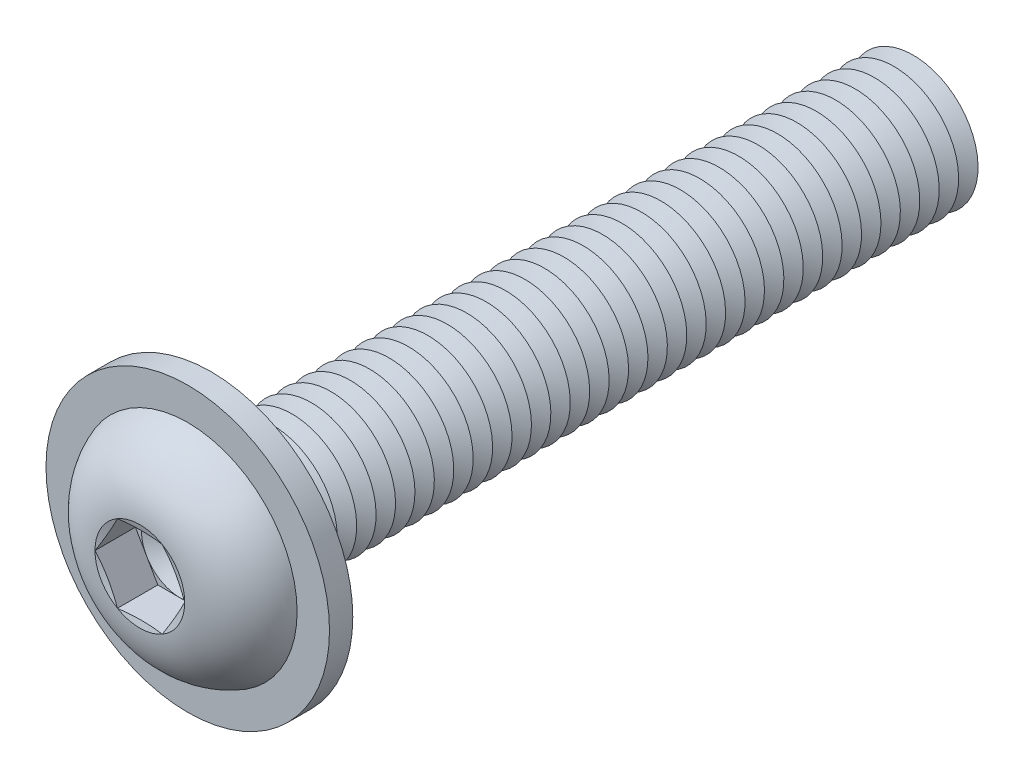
ISO-10303-21;
HEADER;
FILE_DESCRIPTION(('STEP AP214'),'2;1');
FILE_NAME('part.step','',(''),(''),'','','');
FILE_SCHEMA(('AUTOMOTIVE_DESIGN { 1 0 10303 214 1 1 1 1 }'));
ENDSEC;
DATA;
#1=APPLICATION_CONTEXT('core data for automotive mechanical design processes');
#2=APPLICATION_PROTOCOL_DEFINITION('international standard','automotive_design',2000,#1);
#3=PRODUCT_CONTEXT('',#1,'mechanical');
#4=PRODUCT('Part','Part','',(#3));
#5=PRODUCT_RELATED_PRODUCT_CATEGORY('part','',(#4));
#6=PRODUCT_DEFINITION_FORMATION('','',#4);
#7=PRODUCT_DEFINITION_CONTEXT('part definition',#1,'design');
#8=PRODUCT_DEFINITION('design','',#6,#7);
#9=PRODUCT_DEFINITION_SHAPE('','',#8);
#10=(LENGTH_UNIT() NAMED_UNIT(*) SI_UNIT(.MILLI.,.METRE.));
#11=(NAMED_UNIT(*) PLANE_ANGLE_UNIT() SI_UNIT($,.RADIAN.));
#12=(NAMED_UNIT(*) SI_UNIT($,.STERADIAN.) SOLID_ANGLE_UNIT());
#13=UNCERTAINTY_MEASURE_WITH_UNIT(LENGTH_MEASURE(1.E-05),#10,'distance_accuracy_value','');
#14=(GEOMETRIC_REPRESENTATION_CONTEXT(3) GLOBAL_UNCERTAINTY_ASSIGNED_CONTEXT((#13)) GLOBAL_UNIT_ASSIGNED_CONTEXT((#10,
#11,#12)) REPRESENTATION_CONTEXT('',''));
#15=CARTESIAN_POINT('',(0.,0.,0.));
#16=DIRECTION('',(0.,0.,1.));
#17=DIRECTION('',(1.,0.,0.));
#18=AXIS2_PLACEMENT_3D('',#15,#16,#17);
#19=CARTESIAN_POINT('',(0.,0.,-49.75));
#20=DIRECTION('',(0.,0.,1.));
#21=DIRECTION('',(0.,-1.,0.));
#22=AXIS2_PLACEMENT_3D('',#19,#20,#21);
#23=CONICAL_SURFACE('',#22,4.99999999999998,1.0471975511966);
#24=CARTESIAN_POINT('',(0.,0.,-50.5));
#25=DIRECTION('',(0.,0.,1.));
#26=DIRECTION('',(0.,-1.,0.));
#27=AXIS2_PLACEMENT_3D('',#24,#25,#26);
#28=CIRCLE('',#27,3.70096189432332);
#29=CARTESIAN_POINT('',(0.,-3.70096189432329,-50.5));
#30=VERTEX_POINT('',#29);
#31=EDGE_CURVE('E363',#30,#30,#28,.T.);
#32=ORIENTED_EDGE('',*,*,#31,.T.);
#33=EDGE_LOOP('',(#32));
#34=FACE_BOUND('',#33,.T.);
#35=CARTESIAN_POINT('',(0.,0.,-49.75));
#36=DIRECTION('',(0.,0.,1.));
#37=DIRECTION('',(0.,-1.,0.));
#38=AXIS2_PLACEMENT_3D('',#35,#36,#37);
#39=CIRCLE('',#38,4.99999999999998);
#40=CARTESIAN_POINT('',(0.,-4.99999999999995,-49.75));
#41=VERTEX_POINT('',#40);
#42=EDGE_CURVE('E347',#41,#41,#39,.T.);
#43=ORIENTED_EDGE('',*,*,#42,.F.);
#44=EDGE_LOOP('',(#43));
#45=FACE_BOUND('',#44,.T.);
#46=ADVANCED_FACE('F39',(#34,#45),#23,.T.);
#47=CARTESIAN_POINT('',(0.,0.,-50.5));
#48=DIRECTION('',(0.,0.,-1.));
#49=DIRECTION('',(0.,1.,0.));
#50=AXIS2_PLACEMENT_3D('',#47,#48,#49);
#51=CONICAL_SURFACE('',#50,3.70096189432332,1.0471975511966);
#52=CARTESIAN_POINT('',(0.,0.,-51.25));
#53=DIRECTION('',(0.,0.,1.));
#54=DIRECTION('',(0.,-1.,0.));
#55=AXIS2_PLACEMENT_3D('',#52,#53,#54);
#56=CIRCLE('',#55,4.99999999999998);
#57=CARTESIAN_POINT('',(0.,-4.99999999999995,-51.25));
#58=VERTEX_POINT('',#57);
#59=EDGE_CURVE('E353',#58,#58,#56,.T.);
#60=ORIENTED_EDGE('',*,*,#59,.T.);
#61=EDGE_LOOP('',(#60));
#62=FACE_BOUND('',#61,.T.);
#63=ORIENTED_EDGE('',*,*,#31,.F.);
#64=EDGE_LOOP('',(#63));
#65=FACE_BOUND('',#64,.T.);
#66=ADVANCED_FACE('F381',(#62,#65),#51,.T.);
#67=CARTESIAN_POINT('',(0.,4.99999999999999,-55.));
#68=DIRECTION('',(0.,0.,-1.));
#69=DIRECTION('',(0.,1.,0.));
#70=AXIS2_PLACEMENT_3D('',#67,#68,#69);
#71=PLANE('',#70);
#72=CARTESIAN_POINT('',(0.,0.,-55.));
#73=DIRECTION('',(0.,0.,1.));
#74=DIRECTION('',(0.,-1.,0.));
#75=AXIS2_PLACEMENT_3D('',#72,#73,#74);
#76=CIRCLE('',#75,3.70096189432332);
#77=CARTESIAN_POINT('',(0.,-3.70096189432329,-55.));
#78=VERTEX_POINT('',#77);
#79=EDGE_CURVE('E323',#78,#78,#76,.T.);
#80=ORIENTED_EDGE('',*,*,#79,.F.);
#81=EDGE_LOOP('',(#80));
#82=FACE_BOUND('',#81,.T.);
#83=ADVANCED_FACE('F379',(#82),#71,.T.);
#84=CARTESIAN_POINT('',(0.,0.,-54.25));
#85=DIRECTION('',(0.,0.,1.));
#86=DIRECTION('',(0.,-1.,0.));
#87=AXIS2_PLACEMENT_3D('',#84,#85,#86);
#88=CONICAL_SURFACE('',#87,4.99999999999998,1.0471975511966);
#89=ORIENTED_EDGE('',*,*,#79,.T.);
#90=EDGE_LOOP('',(#89));
#91=FACE_BOUND('',#90,.T.);
#92=CARTESIAN_POINT('',(0.,0.,-54.25));
#93=DIRECTION('',(0.,0.,1.));
#94=DIRECTION('',(0.,-1.,0.));
#95=AXIS2_PLACEMENT_3D('',#92,#93,#94);
#96=CIRCLE('',#95,4.99999999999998);
#97=CARTESIAN_POINT('',(0.,-4.99999999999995,-54.25));
#98=VERTEX_POINT('',#97);
#99=EDGE_CURVE('E370',#98,#98,#96,.T.);
#100=ORIENTED_EDGE('',*,*,#99,.F.);
#101=EDGE_LOOP('',(#100));
#102=FACE_BOUND('',#101,.T.);
#103=ADVANCED_FACE('F376',(#91,#102),#88,.T.);
#104=CARTESIAN_POINT('',(0.,0.,-53.5));
#105=DIRECTION('',(0.,0.,-1.));
#106=DIRECTION('',(0.,1.,0.));
#107=AXIS2_PLACEMENT_3D('',#104,#105,#106);
#108=CONICAL_SURFACE('',#107,3.70096189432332,1.0471975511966);
#109=ORIENTED_EDGE('',*,*,#99,.T.);
#110=EDGE_LOOP('',(#109));
#111=FACE_BOUND('',#110,.T.);
#112=CARTESIAN_POINT('',(0.,0.,-53.5));
#113=DIRECTION('',(0.,0.,1.));
#114=DIRECTION('',(0.,-1.,0.));
#115=AXIS2_PLACEMENT_3D('',#112,#113,#114);
#116=CIRCLE('',#115,3.70096189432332);
#117=CARTESIAN_POINT('',(0.,-3.70096189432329,-53.5));
#118=VERTEX_POINT('',#117);
#119=EDGE_CURVE('E359',#118,#118,#116,.T.);
#120=ORIENTED_EDGE('',*,*,#119,.F.);
#121=EDGE_LOOP('',(#120));
#122=FACE_BOUND('',#121,.T.);
#123=ADVANCED_FACE('F386',(#111,#122),#108,.T.);
#124=CARTESIAN_POINT('',(0.,0.,-52.75));
#125=DIRECTION('',(0.,0.,1.));
#126=DIRECTION('',(0.,-1.,0.));
#127=AXIS2_PLACEMENT_3D('',#124,#125,#126);
#128=CONICAL_SURFACE('',#127,4.99999999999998,1.0471975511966);
#129=ORIENTED_EDGE('',*,*,#119,.T.);
#130=EDGE_LOOP('',(#129));
#131=FACE_BOUND('',#130,.T.);
#132=CARTESIAN_POINT('',(0.,0.,-52.75));
#133=DIRECTION('',(0.,0.,1.));
#134=DIRECTION('',(0.,-1.,0.));
#135=AXIS2_PLACEMENT_3D('',#132,#133,#134);
#136=CIRCLE('',#135,4.99999999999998);
#137=CARTESIAN_POINT('',(0.,-4.99999999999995,-52.75));
#138=VERTEX_POINT('',#137);
#139=EDGE_CURVE('E352',#138,#138,#136,.T.);
#140=ORIENTED_EDGE('',*,*,#139,.F.);
#141=EDGE_LOOP('',(#140));
#142=FACE_BOUND('',#141,.T.);
#143=ADVANCED_FACE('F403',(#131,#142),#128,.T.);
#144=CARTESIAN_POINT('',(0.,0.,-52.));
#145=DIRECTION('',(0.,0.,-1.));
#146=DIRECTION('',(0.,1.,0.));
#147=AXIS2_PLACEMENT_3D('',#144,#145,#146);
#148=CONICAL_SURFACE('',#147,3.70096189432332,1.0471975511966);
#149=ORIENTED_EDGE('',*,*,#139,.T.);
#150=EDGE_LOOP('',(#149));
#151=FACE_BOUND('',#150,.T.);
#152=CARTESIAN_POINT('',(0.,0.,-52.));
#153=DIRECTION('',(0.,0.,1.));
#154=DIRECTION('',(0.,-1.,0.));
#155=AXIS2_PLACEMENT_3D('',#152,#153,#154);
#156=CIRCLE('',#155,3.70096189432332);
#157=CARTESIAN_POINT('',(0.,-3.70096189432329,-52.));
#158=VERTEX_POINT('',#157);
#159=EDGE_CURVE('E350',#158,#158,#156,.T.);
#160=ORIENTED_EDGE('',*,*,#159,.F.);
#161=EDGE_LOOP('',(#160));
#162=FACE_BOUND('',#161,.T.);
#163=ADVANCED_FACE('F399',(#151,#162),#148,.T.);
#164=CARTESIAN_POINT('',(0.,0.,-51.25));
#165=DIRECTION('',(0.,0.,1.));
#166=DIRECTION('',(0.,-1.,0.));
#167=AXIS2_PLACEMENT_3D('',#164,#165,#166);
#168=CONICAL_SURFACE('',#167,4.99999999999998,1.0471975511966);
#169=ORIENTED_EDGE('',*,*,#159,.T.);
#170=EDGE_LOOP('',(#169));
#171=FACE_BOUND('',#170,.T.);
#172=ORIENTED_EDGE('',*,*,#59,.F.);
#173=EDGE_LOOP('',(#172));
#174=FACE_BOUND('',#173,.T.);
#175=ADVANCED_FACE('F402',(#171,#174),#168,.T.);
#176=CARTESIAN_POINT('',(0.,0.,-48.25));
#177=DIRECTION('',(0.,0.,1.));
#178=DIRECTION('',(0.,-1.,0.));
#179=AXIS2_PLACEMENT_3D('',#176,#177,#178);
#180=CONICAL_SURFACE('',#179,4.99999999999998,1.0471975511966);
#181=CARTESIAN_POINT('',(0.,0.,-49.));
#182=DIRECTION('',(0.,0.,1.));
#183=DIRECTION('',(0.,-1.,0.));
#184=AXIS2_PLACEMENT_3D('',#181,#182,#183);
#185=CIRCLE('',#184,3.70096189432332);
#186=CARTESIAN_POINT('',(0.,-3.7009618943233,-49.));
#187=VERTEX_POINT('',#186);
#188=EDGE_CURVE('E345',#187,#187,#185,.T.);
#189=ORIENTED_EDGE('',*,*,#188,.T.);
#190=EDGE_LOOP('',(#189));
#191=FACE_BOUND('',#190,.T.);
#192=CARTESIAN_POINT('',(0.,0.,-48.25));
#193=DIRECTION('',(0.,0.,1.));
#194=DIRECTION('',(0.,-1.,0.));
#195=AXIS2_PLACEMENT_3D('',#192,#193,#194);
#196=CIRCLE('',#195,4.99999999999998);
#197=CARTESIAN_POINT('',(0.,-4.99999999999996,-48.25));
#198=VERTEX_POINT('',#197);
#199=EDGE_CURVE('E348',#198,#198,#196,.T.);
#200=ORIENTED_EDGE('',*,*,#199,.F.);
#201=EDGE_LOOP('',(#200));
#202=FACE_BOUND('',#201,.T.);
#203=ADVANCED_FACE('F407',(#191,#202),#180,.T.);
#204=CARTESIAN_POINT('',(0.,0.,-49.));
#205=DIRECTION('',(0.,0.,-1.));
#206=DIRECTION('',(0.,1.,0.));
#207=AXIS2_PLACEMENT_3D('',#204,#205,#206);
#208=CONICAL_SURFACE('',#207,3.70096189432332,1.0471975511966);
#209=ORIENTED_EDGE('',*,*,#42,.T.);
#210=EDGE_LOOP('',(#209));
#211=FACE_BOUND('',#210,.T.);
#212=ORIENTED_EDGE('',*,*,#188,.F.);
#213=EDGE_LOOP('',(#212));
#214=FACE_BOUND('',#213,.T.);
#215=ADVANCED_FACE('F433',(#211,#214),#208,.T.);
#216=CARTESIAN_POINT('',(0.,0.,-46.75));
#217=DIRECTION('',(0.,0.,1.));
#218=DIRECTION('',(0.,-1.,0.));
#219=AXIS2_PLACEMENT_3D('',#216,#217,#218);
#220=CONICAL_SURFACE('',#219,4.99999999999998,1.0471975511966);
#221=CARTESIAN_POINT('',(0.,0.,-47.5));
#222=DIRECTION('',(0.,0.,1.));
#223=DIRECTION('',(0.,-1.,0.));
#224=AXIS2_PLACEMENT_3D('',#221,#222,#223);
#225=CIRCLE('',#224,3.70096189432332);
#226=CARTESIAN_POINT('',(0.,-3.7009618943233,-47.5));
#227=VERTEX_POINT('',#226);
#228=EDGE_CURVE('E1456',#227,#227,#225,.T.);
#229=ORIENTED_EDGE('',*,*,#228,.T.);
#230=EDGE_LOOP('',(#229));
#231=FACE_BOUND('',#230,.T.);
#232=CARTESIAN_POINT('',(0.,0.,-46.75));
#233=DIRECTION('',(0.,0.,1.));
#234=DIRECTION('',(0.,-1.,0.));
#235=AXIS2_PLACEMENT_3D('',#232,#233,#234);
#236=CIRCLE('',#235,4.99999999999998);
#237=CARTESIAN_POINT('',(0.,-4.99999999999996,-46.75));
#238=VERTEX_POINT('',#237);
#239=EDGE_CURVE('E1450',#238,#238,#236,.T.);
#240=ORIENTED_EDGE('',*,*,#239,.F.);
#241=EDGE_LOOP('',(#240));
#242=FACE_BOUND('',#241,.T.);
#243=ADVANCED_FACE('F439',(#231,#242),#220,.T.);
#244=CARTESIAN_POINT('',(0.,0.,-47.5));
#245=DIRECTION('',(0.,0.,-1.));
#246=DIRECTION('',(0.,1.,0.));
#247=AXIS2_PLACEMENT_3D('',#244,#245,#246);
#248=CONICAL_SURFACE('',#247,3.70096189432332,1.0471975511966);
#249=ORIENTED_EDGE('',*,*,#199,.T.);
#250=EDGE_LOOP('',(#249));
#251=FACE_BOUND('',#250,.T.);
#252=ORIENTED_EDGE('',*,*,#228,.F.);
#253=EDGE_LOOP('',(#252));
#254=FACE_BOUND('',#253,.T.);
#255=ADVANCED_FACE('F446',(#251,#254),#248,.T.);
#256=CARTESIAN_POINT('',(0.,0.,-45.25));
#257=DIRECTION('',(0.,0.,1.));
#258=DIRECTION('',(0.,-1.,0.));
#259=AXIS2_PLACEMENT_3D('',#256,#257,#258);
#260=CONICAL_SURFACE('',#259,4.99999999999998,1.0471975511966);
#261=CARTESIAN_POINT('',(0.,0.,-46.));
#262=DIRECTION('',(0.,0.,1.));
#263=DIRECTION('',(0.,-1.,0.));
#264=AXIS2_PLACEMENT_3D('',#261,#262,#263);
#265=CIRCLE('',#264,3.70096189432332);
#266=CARTESIAN_POINT('',(0.,-3.7009618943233,-46.));
#267=VERTEX_POINT('',#266);
#268=EDGE_CURVE('E1448',#267,#267,#265,.T.);
#269=ORIENTED_EDGE('',*,*,#268,.T.);
#270=EDGE_LOOP('',(#269));
#271=FACE_BOUND('',#270,.T.);
#272=CARTESIAN_POINT('',(0.,0.,-45.25));
#273=DIRECTION('',(0.,0.,1.));
#274=DIRECTION('',(0.,-1.,0.));
#275=AXIS2_PLACEMENT_3D('',#272,#273,#274);
#276=CIRCLE('',#275,4.99999999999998);
#277=CARTESIAN_POINT('',(0.,-4.99999999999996,-45.25));
#278=VERTEX_POINT('',#277);
#279=EDGE_CURVE('E1451',#278,#278,#276,.T.);
#280=ORIENTED_EDGE('',*,*,#279,.F.);
#281=EDGE_LOOP('',(#280));
#282=FACE_BOUND('',#281,.T.);
#283=ADVANCED_FACE('F453',(#271,#282),#260,.T.);
#284=CARTESIAN_POINT('',(0.,0.,-46.));
#285=DIRECTION('',(0.,0.,-1.));
#286=DIRECTION('',(0.,1.,0.));
#287=AXIS2_PLACEMENT_3D('',#284,#285,#286);
#288=CONICAL_SURFACE('',#287,3.70096189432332,1.0471975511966);
#289=ORIENTED_EDGE('',*,*,#239,.T.);
#290=EDGE_LOOP('',(#289));
#291=FACE_BOUND('',#290,.T.);
#292=ORIENTED_EDGE('',*,*,#268,.F.);
#293=EDGE_LOOP('',(#292));
#294=FACE_BOUND('',#293,.T.);
#295=ADVANCED_FACE('F460',(#291,#294),#288,.T.);
#296=CARTESIAN_POINT('',(0.,0.,-43.75));
#297=DIRECTION('',(0.,0.,1.));
#298=DIRECTION('',(0.,-1.,0.));
#299=AXIS2_PLACEMENT_3D('',#296,#297,#298);
#300=CONICAL_SURFACE('',#299,4.99999999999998,1.0471975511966);
#301=CARTESIAN_POINT('',(0.,0.,-44.5));
#302=DIRECTION('',(0.,0.,1.));
#303=DIRECTION('',(0.,-1.,0.));
#304=AXIS2_PLACEMENT_3D('',#301,#302,#303);
#305=CIRCLE('',#304,3.70096189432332);
#306=CARTESIAN_POINT('',(0.,-3.7009618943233,-44.5));
#307=VERTEX_POINT('',#306);
#308=EDGE_CURVE('E1460',#307,#307,#305,.T.);
#309=ORIENTED_EDGE('',*,*,#308,.T.);
#310=EDGE_LOOP('',(#309));
#311=FACE_BOUND('',#310,.T.);
#312=CARTESIAN_POINT('',(0.,0.,-43.75));
#313=DIRECTION('',(0.,0.,1.));
#314=DIRECTION('',(0.,-1.,0.));
#315=AXIS2_PLACEMENT_3D('',#312,#313,#314);
#316=CIRCLE('',#315,4.99999999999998);
#317=CARTESIAN_POINT('',(0.,-4.99999999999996,-43.75));
#318=VERTEX_POINT('',#317);
#319=EDGE_CURVE('E1570',#318,#318,#316,.T.);
#320=ORIENTED_EDGE('',*,*,#319,.F.);
#321=EDGE_LOOP('',(#320));
#322=FACE_BOUND('',#321,.T.);
#323=ADVANCED_FACE('F467',(#311,#322),#300,.T.);
#324=CARTESIAN_POINT('',(0.,0.,-44.5));
#325=DIRECTION('',(0.,0.,-1.));
#326=DIRECTION('',(0.,1.,0.));
#327=AXIS2_PLACEMENT_3D('',#324,#325,#326);
#328=CONICAL_SURFACE('',#327,3.70096189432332,1.0471975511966);
#329=ORIENTED_EDGE('',*,*,#279,.T.);
#330=EDGE_LOOP('',(#329));
#331=FACE_BOUND('',#330,.T.);
#332=ORIENTED_EDGE('',*,*,#308,.F.);
#333=EDGE_LOOP('',(#332));
#334=FACE_BOUND('',#333,.T.);
#335=ADVANCED_FACE('F474',(#331,#334),#328,.T.);
#336=CARTESIAN_POINT('',(0.,0.,-42.25));
#337=DIRECTION('',(0.,0.,1.));
#338=DIRECTION('',(0.,-1.,0.));
#339=AXIS2_PLACEMENT_3D('',#336,#337,#338);
#340=CONICAL_SURFACE('',#339,4.99999999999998,1.0471975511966);
#341=CARTESIAN_POINT('',(0.,0.,-43.));
#342=DIRECTION('',(0.,0.,1.));
#343=DIRECTION('',(0.,-1.,0.));
#344=AXIS2_PLACEMENT_3D('',#341,#342,#343);
#345=CIRCLE('',#344,3.70096189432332);
#346=CARTESIAN_POINT('',(0.,-3.7009618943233,-43.));
#347=VERTEX_POINT('',#346);
#348=EDGE_CURVE('E1498',#347,#347,#345,.T.);
#349=ORIENTED_EDGE('',*,*,#348,.T.);
#350=EDGE_LOOP('',(#349));
#351=FACE_BOUND('',#350,.T.);
#352=CARTESIAN_POINT('',(0.,0.,-42.25));
#353=DIRECTION('',(0.,0.,1.));
#354=DIRECTION('',(0.,-1.,0.));
#355=AXIS2_PLACEMENT_3D('',#352,#353,#354);
#356=CIRCLE('',#355,4.99999999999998);
#357=CARTESIAN_POINT('',(0.,-4.99999999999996,-42.25));
#358=VERTEX_POINT('',#357);
#359=EDGE_CURVE('E1495',#358,#358,#356,.T.);
#360=ORIENTED_EDGE('',*,*,#359,.F.);
#361=EDGE_LOOP('',(#360));
#362=FACE_BOUND('',#361,.T.);
#363=ADVANCED_FACE('F481',(#351,#362),#340,.T.);
#364=CARTESIAN_POINT('',(0.,0.,-43.));
#365=DIRECTION('',(0.,0.,-1.));
#366=DIRECTION('',(0.,1.,0.));
#367=AXIS2_PLACEMENT_3D('',#364,#365,#366);
#368=CONICAL_SURFACE('',#367,3.70096189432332,1.0471975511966);
#369=ORIENTED_EDGE('',*,*,#319,.T.);
#370=EDGE_LOOP('',(#369));
#371=FACE_BOUND('',#370,.T.);
#372=ORIENTED_EDGE('',*,*,#348,.F.);
#373=EDGE_LOOP('',(#372));
#374=FACE_BOUND('',#373,.T.);
#375=ADVANCED_FACE('F488',(#371,#374),#368,.T.);
#376=CARTESIAN_POINT('',(0.,0.,-40.75));
#377=DIRECTION('',(0.,0.,1.));
#378=DIRECTION('',(0.,-1.,0.));
#379=AXIS2_PLACEMENT_3D('',#376,#377,#378);
#380=CONICAL_SURFACE('',#379,4.99999999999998,1.0471975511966);
#381=CARTESIAN_POINT('',(0.,0.,-41.5));
#382=DIRECTION('',(0.,0.,1.));
#383=DIRECTION('',(0.,-1.,0.));
#384=AXIS2_PLACEMENT_3D('',#381,#382,#383);
#385=CIRCLE('',#384,3.70096189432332);
#386=CARTESIAN_POINT('',(0.,-3.7009618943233,-41.5));
#387=VERTEX_POINT('',#386);
#388=EDGE_CURVE('E1499',#387,#387,#385,.T.);
#389=ORIENTED_EDGE('',*,*,#388,.T.);
#390=EDGE_LOOP('',(#389));
#391=FACE_BOUND('',#390,.T.);
#392=CARTESIAN_POINT('',(0.,0.,-40.75));
#393=DIRECTION('',(0.,0.,1.));
#394=DIRECTION('',(0.,-1.,0.));
#395=AXIS2_PLACEMENT_3D('',#392,#393,#394);
#396=CIRCLE('',#395,4.99999999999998);
#397=CARTESIAN_POINT('',(0.,-4.99999999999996,-40.75));
#398=VERTEX_POINT('',#397);
#399=EDGE_CURVE('E1513',#398,#398,#396,.T.);
#400=ORIENTED_EDGE('',*,*,#399,.F.);
#401=EDGE_LOOP('',(#400));
#402=FACE_BOUND('',#401,.T.);
#403=ADVANCED_FACE('F495',(#391,#402),#380,.T.);
#404=CARTESIAN_POINT('',(0.,0.,-41.5));
#405=DIRECTION('',(0.,0.,-1.));
#406=DIRECTION('',(0.,1.,0.));
#407=AXIS2_PLACEMENT_3D('',#404,#405,#406);
#408=CONICAL_SURFACE('',#407,3.70096189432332,1.0471975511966);
#409=ORIENTED_EDGE('',*,*,#359,.T.);
#410=EDGE_LOOP('',(#409));
#411=FACE_BOUND('',#410,.T.);
#412=ORIENTED_EDGE('',*,*,#388,.F.);
#413=EDGE_LOOP('',(#412));
#414=FACE_BOUND('',#413,.T.);
#415=ADVANCED_FACE('F502',(#411,#414),#408,.T.);
#416=CARTESIAN_POINT('',(0.,0.,-39.25));
#417=DIRECTION('',(0.,0.,1.));
#418=DIRECTION('',(0.,-1.,0.));
#419=AXIS2_PLACEMENT_3D('',#416,#417,#418);
#420=CONICAL_SURFACE('',#419,4.99999999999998,1.0471975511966);
#421=CARTESIAN_POINT('',(0.,0.,-40.));
#422=DIRECTION('',(0.,0.,1.));
#423=DIRECTION('',(0.,-1.,0.));
#424=AXIS2_PLACEMENT_3D('',#421,#422,#423);
#425=CIRCLE('',#424,3.70096189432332);
#426=CARTESIAN_POINT('',(0.,-3.7009618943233,-40.));
#427=VERTEX_POINT('',#426);
#428=EDGE_CURVE('E1515',#427,#427,#425,.T.);
#429=ORIENTED_EDGE('',*,*,#428,.T.);
#430=EDGE_LOOP('',(#429));
#431=FACE_BOUND('',#430,.T.);
#432=CARTESIAN_POINT('',(0.,0.,-39.25));
#433=DIRECTION('',(0.,0.,1.));
#434=DIRECTION('',(0.,-1.,0.));
#435=AXIS2_PLACEMENT_3D('',#432,#433,#434);
#436=CIRCLE('',#435,4.99999999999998);
#437=CARTESIAN_POINT('',(0.,-4.99999999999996,-39.25));
#438=VERTEX_POINT('',#437);
#439=EDGE_CURVE('E1541',#438,#438,#436,.T.);
#440=ORIENTED_EDGE('',*,*,#439,.F.);
#441=EDGE_LOOP('',(#440));
#442=FACE_BOUND('',#441,.T.);
#443=ADVANCED_FACE('F509',(#431,#442),#420,.T.);
#444=CARTESIAN_POINT('',(0.,0.,-40.));
#445=DIRECTION('',(0.,0.,-1.));
#446=DIRECTION('',(0.,1.,0.));
#447=AXIS2_PLACEMENT_3D('',#444,#445,#446);
#448=CONICAL_SURFACE('',#447,3.70096189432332,1.0471975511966);
#449=ORIENTED_EDGE('',*,*,#399,.T.);
#450=EDGE_LOOP('',(#449));
#451=FACE_BOUND('',#450,.T.);
#452=ORIENTED_EDGE('',*,*,#428,.F.);
#453=EDGE_LOOP('',(#452));
#454=FACE_BOUND('',#453,.T.);
#455=ADVANCED_FACE('F516',(#451,#454),#448,.T.);
#456=CARTESIAN_POINT('',(0.,0.,-37.75));
#457=DIRECTION('',(0.,0.,1.));
#458=DIRECTION('',(0.,-1.,0.));
#459=AXIS2_PLACEMENT_3D('',#456,#457,#458);
#460=CONICAL_SURFACE('',#459,4.99999999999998,1.0471975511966);
#461=CARTESIAN_POINT('',(0.,0.,-38.5));
#462=DIRECTION('',(0.,0.,1.));
#463=DIRECTION('',(0.,-1.,0.));
#464=AXIS2_PLACEMENT_3D('',#461,#462,#463);
#465=CIRCLE('',#464,3.70096189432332);
#466=CARTESIAN_POINT('',(0.,-3.7009618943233,-38.5));
#467=VERTEX_POINT('',#466);
#468=EDGE_CURVE('E1539',#467,#467,#465,.T.);
#469=ORIENTED_EDGE('',*,*,#468,.T.);
#470=EDGE_LOOP('',(#469));
#471=FACE_BOUND('',#470,.T.);
#472=CARTESIAN_POINT('',(0.,0.,-37.75));
#473=DIRECTION('',(0.,0.,1.));
#474=DIRECTION('',(0.,-1.,0.));
#475=AXIS2_PLACEMENT_3D('',#472,#473,#474);
#476=CIRCLE('',#475,4.99999999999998);
#477=CARTESIAN_POINT('',(0.,-4.99999999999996,-37.75));
#478=VERTEX_POINT('',#477);
#479=EDGE_CURVE('E1542',#478,#478,#476,.T.);
#480=ORIENTED_EDGE('',*,*,#479,.F.);
#481=EDGE_LOOP('',(#480));
#482=FACE_BOUND('',#481,.T.);
#483=ADVANCED_FACE('F523',(#471,#482),#460,.T.);
#484=CARTESIAN_POINT('',(0.,0.,-38.5));
#485=DIRECTION('',(0.,0.,-1.));
#486=DIRECTION('',(0.,1.,0.));
#487=AXIS2_PLACEMENT_3D('',#484,#485,#486);
#488=CONICAL_SURFACE('',#487,3.70096189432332,1.0471975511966);
#489=ORIENTED_EDGE('',*,*,#439,.T.);
#490=EDGE_LOOP('',(#489));
#491=FACE_BOUND('',#490,.T.);
#492=ORIENTED_EDGE('',*,*,#468,.F.);
#493=EDGE_LOOP('',(#492));
#494=FACE_BOUND('',#493,.T.);
#495=ADVANCED_FACE('F530',(#491,#494),#488,.T.);
#496=CARTESIAN_POINT('',(0.,0.,-36.25));
#497=DIRECTION('',(0.,0.,1.));
#498=DIRECTION('',(0.,-1.,0.));
#499=AXIS2_PLACEMENT_3D('',#496,#497,#498);
#500=CONICAL_SURFACE('',#499,4.99999999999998,1.0471975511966);
#501=CARTESIAN_POINT('',(0.,0.,-37.));
#502=DIRECTION('',(0.,0.,1.));
#503=DIRECTION('',(0.,-1.,0.));
#504=AXIS2_PLACEMENT_3D('',#501,#502,#503);
#505=CIRCLE('',#504,3.70096189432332);
#506=CARTESIAN_POINT('',(0.,-3.7009618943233,-37.));
#507=VERTEX_POINT('',#506);
#508=EDGE_CURVE('E1523',#507,#507,#505,.T.);
#509=ORIENTED_EDGE('',*,*,#508,.T.);
#510=EDGE_LOOP('',(#509));
#511=FACE_BOUND('',#510,.T.);
#512=CARTESIAN_POINT('',(0.,0.,-36.25));
#513=DIRECTION('',(0.,0.,1.));
#514=DIRECTION('',(0.,-1.,0.));
#515=AXIS2_PLACEMENT_3D('',#512,#513,#514);
#516=CIRCLE('',#515,4.99999999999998);
#517=CARTESIAN_POINT('',(0.,-4.99999999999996,-36.25));
#518=VERTEX_POINT('',#517);
#519=EDGE_CURVE('E1446',#518,#518,#516,.T.);
#520=ORIENTED_EDGE('',*,*,#519,.F.);
#521=EDGE_LOOP('',(#520));
#522=FACE_BOUND('',#521,.T.);
#523=ADVANCED_FACE('F537',(#511,#522),#500,.T.);
#524=CARTESIAN_POINT('',(0.,0.,-37.));
#525=DIRECTION('',(0.,0.,-1.));
#526=DIRECTION('',(0.,1.,0.));
#527=AXIS2_PLACEMENT_3D('',#524,#525,#526);
#528=CONICAL_SURFACE('',#527,3.70096189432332,1.0471975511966);
#529=ORIENTED_EDGE('',*,*,#479,.T.);
#530=EDGE_LOOP('',(#529));
#531=FACE_BOUND('',#530,.T.);
#532=ORIENTED_EDGE('',*,*,#508,.F.);
#533=EDGE_LOOP('',(#532));
#534=FACE_BOUND('',#533,.T.);
#535=ADVANCED_FACE('F544',(#531,#534),#528,.T.);
#536=CARTESIAN_POINT('',(0.,0.,-34.75));
#537=DIRECTION('',(0.,0.,1.));
#538=DIRECTION('',(0.,-1.,0.));
#539=AXIS2_PLACEMENT_3D('',#536,#537,#538);
#540=CONICAL_SURFACE('',#539,4.99999999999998,1.0471975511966);
#541=CARTESIAN_POINT('',(0.,0.,-35.5));
#542=DIRECTION('',(0.,0.,1.));
#543=DIRECTION('',(0.,-1.,0.));
#544=AXIS2_PLACEMENT_3D('',#541,#542,#543);
#545=CIRCLE('',#544,3.70096189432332);
#546=CARTESIAN_POINT('',(0.,-3.7009618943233,-35.5));
#547=VERTEX_POINT('',#546);
#548=EDGE_CURVE('E1441',#547,#547,#545,.T.);
#549=ORIENTED_EDGE('',*,*,#548,.T.);
#550=EDGE_LOOP('',(#549));
#551=FACE_BOUND('',#550,.T.);
#552=CARTESIAN_POINT('',(0.,0.,-34.75));
#553=DIRECTION('',(0.,0.,1.));
#554=DIRECTION('',(0.,-1.,0.));
#555=AXIS2_PLACEMENT_3D('',#552,#553,#554);
#556=CIRCLE('',#555,4.99999999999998);
#557=CARTESIAN_POINT('',(0.,-4.99999999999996,-34.75));
#558=VERTEX_POINT('',#557);
#559=EDGE_CURVE('E1438',#558,#558,#556,.T.);
#560=ORIENTED_EDGE('',*,*,#559,.F.);
#561=EDGE_LOOP('',(#560));
#562=FACE_BOUND('',#561,.T.);
#563=ADVANCED_FACE('F551',(#551,#562),#540,.T.);
#564=CARTESIAN_POINT('',(0.,0.,-35.5));
#565=DIRECTION('',(0.,0.,-1.));
#566=DIRECTION('',(0.,1.,0.));
#567=AXIS2_PLACEMENT_3D('',#564,#565,#566);
#568=CONICAL_SURFACE('',#567,3.70096189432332,1.0471975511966);
#569=ORIENTED_EDGE('',*,*,#519,.T.);
#570=EDGE_LOOP('',(#569));
#571=FACE_BOUND('',#570,.T.);
#572=ORIENTED_EDGE('',*,*,#548,.F.);
#573=EDGE_LOOP('',(#572));
#574=FACE_BOUND('',#573,.T.);
#575=ADVANCED_FACE('F558',(#571,#574),#568,.T.);
#576=CARTESIAN_POINT('',(0.,0.,-33.25));
#577=DIRECTION('',(0.,0.,1.));
#578=DIRECTION('',(0.,-1.,0.));
#579=AXIS2_PLACEMENT_3D('',#576,#577,#578);
#580=CONICAL_SURFACE('',#579,4.99999999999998,1.0471975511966);
#581=CARTESIAN_POINT('',(0.,0.,-34.));
#582=DIRECTION('',(0.,0.,1.));
#583=DIRECTION('',(0.,-1.,0.));
#584=AXIS2_PLACEMENT_3D('',#581,#582,#583);
#585=CIRCLE('',#584,3.70096189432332);
#586=CARTESIAN_POINT('',(0.,-3.7009618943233,-34.));
#587=VERTEX_POINT('',#586);
#588=EDGE_CURVE('E1442',#587,#587,#585,.T.);
#589=ORIENTED_EDGE('',*,*,#588,.T.);
#590=EDGE_LOOP('',(#589));
#591=FACE_BOUND('',#590,.T.);
#592=CARTESIAN_POINT('',(0.,0.,-33.25));
#593=DIRECTION('',(0.,0.,1.));
#594=DIRECTION('',(0.,-1.,0.));
#595=AXIS2_PLACEMENT_3D('',#592,#593,#594);
#596=CIRCLE('',#595,4.99999999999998);
#597=CARTESIAN_POINT('',(0.,-4.99999999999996,-33.25));
#598=VERTEX_POINT('',#597);
#599=EDGE_CURVE('E342',#598,#598,#596,.T.);
#600=ORIENTED_EDGE('',*,*,#599,.F.);
#601=EDGE_LOOP('',(#600));
#602=FACE_BOUND('',#601,.T.);
#603=ADVANCED_FACE('F565',(#591,#602),#580,.T.);
#604=CARTESIAN_POINT('',(0.,0.,-34.));
#605=DIRECTION('',(0.,0.,-1.));
#606=DIRECTION('',(0.,1.,0.));
#607=AXIS2_PLACEMENT_3D('',#604,#605,#606);
#608=CONICAL_SURFACE('',#607,3.70096189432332,1.0471975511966);
#609=ORIENTED_EDGE('',*,*,#559,.T.);
#610=EDGE_LOOP('',(#609));
#611=FACE_BOUND('',#610,.T.);
#612=ORIENTED_EDGE('',*,*,#588,.F.);
#613=EDGE_LOOP('',(#612));
#614=FACE_BOUND('',#613,.T.);
#615=ADVANCED_FACE('F572',(#611,#614),#608,.T.);
#616=CARTESIAN_POINT('',(0.,0.,-31.75));
#617=DIRECTION('',(0.,0.,1.));
#618=DIRECTION('',(0.,-1.,0.));
#619=AXIS2_PLACEMENT_3D('',#616,#617,#618);
#620=CONICAL_SURFACE('',#619,4.99999999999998,1.0471975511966);
#621=CARTESIAN_POINT('',(0.,0.,-32.5));
#622=DIRECTION('',(0.,0.,1.));
#623=DIRECTION('',(0.,-1.,0.));
#624=AXIS2_PLACEMENT_3D('',#621,#622,#623);
#625=CIRCLE('',#624,3.70096189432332);
#626=CARTESIAN_POINT('',(0.,-3.7009618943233,-32.5));
#627=VERTEX_POINT('',#626);
#628=EDGE_CURVE('E339',#627,#627,#625,.T.);
#629=ORIENTED_EDGE('',*,*,#628,.T.);
#630=EDGE_LOOP('',(#629));
#631=FACE_BOUND('',#630,.T.);
#632=CARTESIAN_POINT('',(0.,0.,-31.75));
#633=DIRECTION('',(0.,0.,1.));
#634=DIRECTION('',(0.,-1.,0.));
#635=AXIS2_PLACEMENT_3D('',#632,#633,#634);
#636=CIRCLE('',#635,4.99999999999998);
#637=CARTESIAN_POINT('',(0.,-4.99999999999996,-31.75));
#638=VERTEX_POINT('',#637);
#639=EDGE_CURVE('E343',#638,#638,#636,.T.);
#640=ORIENTED_EDGE('',*,*,#639,.F.);
#641=EDGE_LOOP('',(#640));
#642=FACE_BOUND('',#641,.T.);
#643=ADVANCED_FACE('F579',(#631,#642),#620,.T.);
#644=CARTESIAN_POINT('',(0.,0.,-32.5));
#645=DIRECTION('',(0.,0.,-1.));
#646=DIRECTION('',(0.,1.,0.));
#647=AXIS2_PLACEMENT_3D('',#644,#645,#646);
#648=CONICAL_SURFACE('',#647,3.70096189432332,1.0471975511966);
#649=ORIENTED_EDGE('',*,*,#599,.T.);
#650=EDGE_LOOP('',(#649));
#651=FACE_BOUND('',#650,.T.);
#652=ORIENTED_EDGE('',*,*,#628,.F.);
#653=EDGE_LOOP('',(#652));
#654=FACE_BOUND('',#653,.T.);
#655=ADVANCED_FACE('F586',(#651,#654),#648,.T.);
#656=CARTESIAN_POINT('',(0.,0.,-30.25));
#657=DIRECTION('',(0.,0.,1.));
#658=DIRECTION('',(0.,-1.,0.));
#659=AXIS2_PLACEMENT_3D('',#656,#657,#658);
#660=CONICAL_SURFACE('',#659,4.99999999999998,1.0471975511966);
#661=CARTESIAN_POINT('',(0.,0.,-31.));
#662=DIRECTION('',(0.,0.,1.));
#663=DIRECTION('',(0.,-1.,0.));
#664=AXIS2_PLACEMENT_3D('',#661,#662,#663);
#665=CIRCLE('',#664,3.70096189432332);
#666=CARTESIAN_POINT('',(0.,-3.7009618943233,-31.));
#667=VERTEX_POINT('',#666);
#668=EDGE_CURVE('E1492',#667,#667,#665,.T.);
#669=ORIENTED_EDGE('',*,*,#668,.T.);
#670=EDGE_LOOP('',(#669));
#671=FACE_BOUND('',#670,.T.);
#672=CARTESIAN_POINT('',(0.,0.,-30.25));
#673=DIRECTION('',(0.,0.,1.));
#674=DIRECTION('',(0.,-1.,0.));
#675=AXIS2_PLACEMENT_3D('',#672,#673,#674);
#676=CIRCLE('',#675,4.99999999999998);
#677=CARTESIAN_POINT('',(0.,-4.99999999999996,-30.25));
#678=VERTEX_POINT('',#677);
#679=EDGE_CURVE('E1489',#678,#678,#676,.T.);
#680=ORIENTED_EDGE('',*,*,#679,.F.);
#681=EDGE_LOOP('',(#680));
#682=FACE_BOUND('',#681,.T.);
#683=ADVANCED_FACE('F593',(#671,#682),#660,.T.);
#684=CARTESIAN_POINT('',(0.,0.,-31.));
#685=DIRECTION('',(0.,0.,-1.));
#686=DIRECTION('',(0.,1.,0.));
#687=AXIS2_PLACEMENT_3D('',#684,#685,#686);
#688=CONICAL_SURFACE('',#687,3.70096189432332,1.0471975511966);
#689=ORIENTED_EDGE('',*,*,#639,.T.);
#690=EDGE_LOOP('',(#689));
#691=FACE_BOUND('',#690,.T.);
#692=ORIENTED_EDGE('',*,*,#668,.F.);
#693=EDGE_LOOP('',(#692));
#694=FACE_BOUND('',#693,.T.);
#695=ADVANCED_FACE('F600',(#691,#694),#688,.T.);
#696=CARTESIAN_POINT('',(0.,0.,-28.75));
#697=DIRECTION('',(0.,0.,1.));
#698=DIRECTION('',(0.,-1.,0.));
#699=AXIS2_PLACEMENT_3D('',#696,#697,#698);
#700=CONICAL_SURFACE('',#699,4.99999999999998,1.0471975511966);
#701=CARTESIAN_POINT('',(0.,0.,-29.5));
#702=DIRECTION('',(0.,0.,1.));
#703=DIRECTION('',(0.,-1.,0.));
#704=AXIS2_PLACEMENT_3D('',#701,#702,#703);
#705=CIRCLE('',#704,3.70096189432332);
#706=CARTESIAN_POINT('',(0.,-3.70096189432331,-29.5));
#707=VERTEX_POINT('',#706);
#708=EDGE_CURVE('E1493',#707,#707,#705,.T.);
#709=ORIENTED_EDGE('',*,*,#708,.T.);
#710=EDGE_LOOP('',(#709));
#711=FACE_BOUND('',#710,.T.);
#712=CARTESIAN_POINT('',(0.,0.,-28.75));
#713=DIRECTION('',(0.,0.,1.));
#714=DIRECTION('',(0.,-1.,0.));
#715=AXIS2_PLACEMENT_3D('',#712,#713,#714);
#716=CIRCLE('',#715,4.99999999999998);
#717=CARTESIAN_POINT('',(0.,-4.99999999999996,-28.75));
#718=VERTEX_POINT('',#717);
#719=EDGE_CURVE('E1562',#718,#718,#716,.T.);
#720=ORIENTED_EDGE('',*,*,#719,.F.);
#721=EDGE_LOOP('',(#720));
#722=FACE_BOUND('',#721,.T.);
#723=ADVANCED_FACE('F607',(#711,#722),#700,.T.);
#724=CARTESIAN_POINT('',(0.,0.,-29.5));
#725=DIRECTION('',(0.,0.,-1.));
#726=DIRECTION('',(0.,1.,0.));
#727=AXIS2_PLACEMENT_3D('',#724,#725,#726);
#728=CONICAL_SURFACE('',#727,3.70096189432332,1.0471975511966);
#729=ORIENTED_EDGE('',*,*,#679,.T.);
#730=EDGE_LOOP('',(#729));
#731=FACE_BOUND('',#730,.T.);
#732=ORIENTED_EDGE('',*,*,#708,.F.);
#733=EDGE_LOOP('',(#732));
#734=FACE_BOUND('',#733,.T.);
#735=ADVANCED_FACE('F614',(#731,#734),#728,.T.);
#736=CARTESIAN_POINT('',(0.,0.,-27.25));
#737=DIRECTION('',(0.,0.,1.));
#738=DIRECTION('',(0.,-1.,0.));
#739=AXIS2_PLACEMENT_3D('',#736,#737,#738);
#740=CONICAL_SURFACE('',#739,4.99999999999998,1.0471975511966);
#741=CARTESIAN_POINT('',(0.,0.,-28.));
#742=DIRECTION('',(0.,0.,1.));
#743=DIRECTION('',(0.,-1.,0.));
#744=AXIS2_PLACEMENT_3D('',#741,#742,#743);
#745=CIRCLE('',#744,3.70096189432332);
#746=CARTESIAN_POINT('',(0.,-3.70096189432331,-28.));
#747=VERTEX_POINT('',#746);
#748=EDGE_CURVE('E1559',#747,#747,#745,.T.);
#749=ORIENTED_EDGE('',*,*,#748,.T.);
#750=EDGE_LOOP('',(#749));
#751=FACE_BOUND('',#750,.T.);
#752=CARTESIAN_POINT('',(0.,0.,-27.25));
#753=DIRECTION('',(0.,0.,1.));
#754=DIRECTION('',(0.,-1.,0.));
#755=AXIS2_PLACEMENT_3D('',#752,#753,#754);
#756=CIRCLE('',#755,4.99999999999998);
#757=CARTESIAN_POINT('',(0.,-4.99999999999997,-27.25));
#758=VERTEX_POINT('',#757);
#759=EDGE_CURVE('E1563',#758,#758,#756,.T.);
#760=ORIENTED_EDGE('',*,*,#759,.F.);
#761=EDGE_LOOP('',(#760));
#762=FACE_BOUND('',#761,.T.);
#763=ADVANCED_FACE('F621',(#751,#762),#740,.T.);
#764=CARTESIAN_POINT('',(0.,0.,-28.));
#765=DIRECTION('',(0.,0.,-1.));
#766=DIRECTION('',(0.,1.,0.));
#767=AXIS2_PLACEMENT_3D('',#764,#765,#766);
#768=CONICAL_SURFACE('',#767,3.70096189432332,1.0471975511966);
#769=ORIENTED_EDGE('',*,*,#719,.T.);
#770=EDGE_LOOP('',(#769));
#771=FACE_BOUND('',#770,.T.);
#772=ORIENTED_EDGE('',*,*,#748,.F.);
#773=EDGE_LOOP('',(#772));
#774=FACE_BOUND('',#773,.T.);
#775=ADVANCED_FACE('F628',(#771,#774),#768,.T.);
#776=CARTESIAN_POINT('',(0.,0.,-25.75));
#777=DIRECTION('',(0.,0.,1.));
#778=DIRECTION('',(0.,-1.,0.));
#779=AXIS2_PLACEMENT_3D('',#776,#777,#778);
#780=CONICAL_SURFACE('',#779,4.99999999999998,1.0471975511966);
#781=CARTESIAN_POINT('',(0.,0.,-26.5));
#782=DIRECTION('',(0.,0.,1.));
#783=DIRECTION('',(0.,-1.,0.));
#784=AXIS2_PLACEMENT_3D('',#781,#782,#783);
#785=CIRCLE('',#784,3.70096189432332);
#786=CARTESIAN_POINT('',(0.,-3.70096189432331,-26.5));
#787=VERTEX_POINT('',#786);
#788=EDGE_CURVE('E1613',#787,#787,#785,.T.);
#789=ORIENTED_EDGE('',*,*,#788,.T.);
#790=EDGE_LOOP('',(#789));
#791=FACE_BOUND('',#790,.T.);
#792=CARTESIAN_POINT('',(0.,0.,-25.75));
#793=DIRECTION('',(0.,0.,1.));
#794=DIRECTION('',(0.,-1.,0.));
#795=AXIS2_PLACEMENT_3D('',#792,#793,#794);
#796=CIRCLE('',#795,4.99999999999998);
#797=CARTESIAN_POINT('',(0.,-4.99999999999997,-25.75));
#798=VERTEX_POINT('',#797);
#799=EDGE_CURVE('E1617',#798,#798,#796,.T.);
#800=ORIENTED_EDGE('',*,*,#799,.F.);
#801=EDGE_LOOP('',(#800));
#802=FACE_BOUND('',#801,.T.);
#803=ADVANCED_FACE('F635',(#791,#802),#780,.T.);
#804=CARTESIAN_POINT('',(0.,0.,-26.5));
#805=DIRECTION('',(0.,0.,-1.));
#806=DIRECTION('',(0.,1.,0.));
#807=AXIS2_PLACEMENT_3D('',#804,#805,#806);
#808=CONICAL_SURFACE('',#807,3.70096189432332,1.0471975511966);
#809=ORIENTED_EDGE('',*,*,#759,.T.);
#810=EDGE_LOOP('',(#809));
#811=FACE_BOUND('',#810,.T.);
#812=ORIENTED_EDGE('',*,*,#788,.F.);
#813=EDGE_LOOP('',(#812));
#814=FACE_BOUND('',#813,.T.);
#815=ADVANCED_FACE('F642',(#811,#814),#808,.T.);
#816=CARTESIAN_POINT('',(0.,0.,-24.25));
#817=DIRECTION('',(0.,0.,1.));
#818=DIRECTION('',(0.,-1.,0.));
#819=AXIS2_PLACEMENT_3D('',#816,#817,#818);
#820=CONICAL_SURFACE('',#819,4.99999999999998,1.0471975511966);
#821=CARTESIAN_POINT('',(0.,0.,-25.));
#822=DIRECTION('',(0.,0.,1.));
#823=DIRECTION('',(0.,-1.,0.));
#824=AXIS2_PLACEMENT_3D('',#821,#822,#823);
#825=CIRCLE('',#824,3.70096189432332);
#826=CARTESIAN_POINT('',(0.,-3.70096189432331,-25.));
#827=VERTEX_POINT('',#826);
#828=EDGE_CURVE('E1435',#827,#827,#825,.T.);
#829=ORIENTED_EDGE('',*,*,#828,.T.);
#830=EDGE_LOOP('',(#829));
#831=FACE_BOUND('',#830,.T.);
#832=CARTESIAN_POINT('',(0.,0.,-24.25));
#833=DIRECTION('',(0.,0.,1.));
#834=DIRECTION('',(0.,-1.,0.));
#835=AXIS2_PLACEMENT_3D('',#832,#833,#834);
#836=CIRCLE('',#835,4.99999999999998);
#837=CARTESIAN_POINT('',(0.,-4.99999999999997,-24.25));
#838=VERTEX_POINT('',#837);
#839=EDGE_CURVE('E1432',#838,#838,#836,.T.);
#840=ORIENTED_EDGE('',*,*,#839,.F.);
#841=EDGE_LOOP('',(#840));
#842=FACE_BOUND('',#841,.T.);
#843=ADVANCED_FACE('F649',(#831,#842),#820,.T.);
#844=CARTESIAN_POINT('',(0.,0.,-25.));
#845=DIRECTION('',(0.,0.,-1.));
#846=DIRECTION('',(0.,1.,0.));
#847=AXIS2_PLACEMENT_3D('',#844,#845,#846);
#848=CONICAL_SURFACE('',#847,3.70096189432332,1.0471975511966);
#849=ORIENTED_EDGE('',*,*,#799,.T.);
#850=EDGE_LOOP('',(#849));
#851=FACE_BOUND('',#850,.T.);
#852=ORIENTED_EDGE('',*,*,#828,.F.);
#853=EDGE_LOOP('',(#852));
#854=FACE_BOUND('',#853,.T.);
#855=ADVANCED_FACE('F656',(#851,#854),#848,.T.);
#856=CARTESIAN_POINT('',(0.,0.,-22.75));
#857=DIRECTION('',(0.,0.,1.));
#858=DIRECTION('',(0.,-1.,0.));
#859=AXIS2_PLACEMENT_3D('',#856,#857,#858);
#860=CONICAL_SURFACE('',#859,4.99999999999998,1.0471975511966);
#861=CARTESIAN_POINT('',(0.,0.,-23.5));
#862=DIRECTION('',(0.,0.,1.));
#863=DIRECTION('',(0.,-1.,0.));
#864=AXIS2_PLACEMENT_3D('',#861,#862,#863);
#865=CIRCLE('',#864,3.70096189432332);
#866=CARTESIAN_POINT('',(0.,-3.70096189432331,-23.5));
#867=VERTEX_POINT('',#866);
#868=EDGE_CURVE('E1436',#867,#867,#865,.T.);
#869=ORIENTED_EDGE('',*,*,#868,.T.);
#870=EDGE_LOOP('',(#869));
#871=FACE_BOUND('',#870,.T.);
#872=CARTESIAN_POINT('',(0.,0.,-22.75));
#873=DIRECTION('',(0.,0.,1.));
#874=DIRECTION('',(0.,-1.,0.));
#875=AXIS2_PLACEMENT_3D('',#872,#873,#874);
#876=CIRCLE('',#875,4.99999999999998);
#877=CARTESIAN_POINT('',(0.,-4.99999999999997,-22.75));
#878=VERTEX_POINT('',#877);
#879=EDGE_CURVE('E1534',#878,#878,#876,.T.);
#880=ORIENTED_EDGE('',*,*,#879,.F.);
#881=EDGE_LOOP('',(#880));
#882=FACE_BOUND('',#881,.T.);
#883=ADVANCED_FACE('F663',(#871,#882),#860,.T.);
#884=CARTESIAN_POINT('',(0.,0.,-23.5));
#885=DIRECTION('',(0.,0.,-1.));
#886=DIRECTION('',(0.,1.,0.));
#887=AXIS2_PLACEMENT_3D('',#884,#885,#886);
#888=CONICAL_SURFACE('',#887,3.70096189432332,1.0471975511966);
#889=ORIENTED_EDGE('',*,*,#839,.T.);
#890=EDGE_LOOP('',(#889));
#891=FACE_BOUND('',#890,.T.);
#892=ORIENTED_EDGE('',*,*,#868,.F.);
#893=EDGE_LOOP('',(#892));
#894=FACE_BOUND('',#893,.T.);
#895=ADVANCED_FACE('F670',(#891,#894),#888,.T.);
#896=CARTESIAN_POINT('',(0.,0.,-21.25));
#897=DIRECTION('',(0.,0.,1.));
#898=DIRECTION('',(0.,-1.,0.));
#899=AXIS2_PLACEMENT_3D('',#896,#897,#898);
#900=CONICAL_SURFACE('',#899,4.99999999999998,1.0471975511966);
#901=CARTESIAN_POINT('',(0.,0.,-22.));
#902=DIRECTION('',(0.,0.,1.));
#903=DIRECTION('',(0.,-1.,0.));
#904=AXIS2_PLACEMENT_3D('',#901,#902,#903);
#905=CIRCLE('',#904,3.70096189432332);
#906=CARTESIAN_POINT('',(0.,-3.70096189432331,-22.));
#907=VERTEX_POINT('',#906);
#908=EDGE_CURVE('E1537',#907,#907,#905,.T.);
#909=ORIENTED_EDGE('',*,*,#908,.T.);
#910=EDGE_LOOP('',(#909));
#911=FACE_BOUND('',#910,.T.);
#912=CARTESIAN_POINT('',(0.,0.,-21.25));
#913=DIRECTION('',(0.,0.,1.));
#914=DIRECTION('',(0.,-1.,0.));
#915=AXIS2_PLACEMENT_3D('',#912,#913,#914);
#916=CIRCLE('',#915,4.99999999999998);
#917=CARTESIAN_POINT('',(0.,-4.99999999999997,-21.25));
#918=VERTEX_POINT('',#917);
#919=EDGE_CURVE('E1627',#918,#918,#916,.T.);
#920=ORIENTED_EDGE('',*,*,#919,.F.);
#921=EDGE_LOOP('',(#920));
#922=FACE_BOUND('',#921,.T.);
#923=ADVANCED_FACE('F677',(#911,#922),#900,.T.);
#924=CARTESIAN_POINT('',(0.,0.,-22.));
#925=DIRECTION('',(0.,0.,-1.));
#926=DIRECTION('',(0.,1.,0.));
#927=AXIS2_PLACEMENT_3D('',#924,#925,#926);
#928=CONICAL_SURFACE('',#927,3.70096189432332,1.0471975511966);
#929=ORIENTED_EDGE('',*,*,#879,.T.);
#930=EDGE_LOOP('',(#929));
#931=FACE_BOUND('',#930,.T.);
#932=ORIENTED_EDGE('',*,*,#908,.F.);
#933=EDGE_LOOP('',(#932));
#934=FACE_BOUND('',#933,.T.);
#935=ADVANCED_FACE('F684',(#931,#934),#928,.T.);
#936=CARTESIAN_POINT('',(0.,0.,-19.75));
#937=DIRECTION('',(0.,0.,1.));
#938=DIRECTION('',(0.,-1.,0.));
#939=AXIS2_PLACEMENT_3D('',#936,#937,#938);
#940=CONICAL_SURFACE('',#939,4.99999999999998,1.0471975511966);
#941=CARTESIAN_POINT('',(0.,0.,-20.5));
#942=DIRECTION('',(0.,0.,1.));
#943=DIRECTION('',(0.,-1.,0.));
#944=AXIS2_PLACEMENT_3D('',#941,#942,#943);
#945=CIRCLE('',#944,3.70096189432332);
#946=CARTESIAN_POINT('',(0.,-3.70096189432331,-20.5));
#947=VERTEX_POINT('',#946);
#948=EDGE_CURVE('E1532',#947,#947,#945,.T.);
#949=ORIENTED_EDGE('',*,*,#948,.T.);
#950=EDGE_LOOP('',(#949));
#951=FACE_BOUND('',#950,.T.);
#952=CARTESIAN_POINT('',(0.,0.,-19.75));
#953=DIRECTION('',(0.,0.,1.));
#954=DIRECTION('',(0.,-1.,0.));
#955=AXIS2_PLACEMENT_3D('',#952,#953,#954);
#956=CIRCLE('',#955,4.99999999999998);
#957=CARTESIAN_POINT('',(0.,-4.99999999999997,-19.75));
#958=VERTEX_POINT('',#957);
#959=EDGE_CURVE('E1520',#958,#958,#956,.T.);
#960=ORIENTED_EDGE('',*,*,#959,.F.);
#961=EDGE_LOOP('',(#960));
#962=FACE_BOUND('',#961,.T.);
#963=ADVANCED_FACE('F691',(#951,#962),#940,.T.);
#964=CARTESIAN_POINT('',(0.,0.,-20.5));
#965=DIRECTION('',(0.,0.,-1.));
#966=DIRECTION('',(0.,1.,0.));
#967=AXIS2_PLACEMENT_3D('',#964,#965,#966);
#968=CONICAL_SURFACE('',#967,3.70096189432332,1.0471975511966);
#969=ORIENTED_EDGE('',*,*,#919,.T.);
#970=EDGE_LOOP('',(#969));
#971=FACE_BOUND('',#970,.T.);
#972=ORIENTED_EDGE('',*,*,#948,.F.);
#973=EDGE_LOOP('',(#972));
#974=FACE_BOUND('',#973,.T.);
#975=ADVANCED_FACE('F698',(#971,#974),#968,.T.);
#976=CARTESIAN_POINT('',(0.,0.,-18.25));
#977=DIRECTION('',(0.,0.,1.));
#978=DIRECTION('',(0.,-1.,0.));
#979=AXIS2_PLACEMENT_3D('',#976,#977,#978);
#980=CONICAL_SURFACE('',#979,4.99999999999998,1.0471975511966);
#981=CARTESIAN_POINT('',(0.,0.,-19.));
#982=DIRECTION('',(0.,0.,1.));
#983=DIRECTION('',(0.,-1.,0.));
#984=AXIS2_PLACEMENT_3D('',#981,#982,#983);
#985=CIRCLE('',#984,3.70096189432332);
#986=CARTESIAN_POINT('',(0.,-3.70096189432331,-19.));
#987=VERTEX_POINT('',#986);
#988=EDGE_CURVE('E1510',#987,#987,#985,.T.);
#989=ORIENTED_EDGE('',*,*,#988,.T.);
#990=EDGE_LOOP('',(#989));
#991=FACE_BOUND('',#990,.T.);
#992=CARTESIAN_POINT('',(0.,0.,-18.25));
#993=DIRECTION('',(0.,0.,1.));
#994=DIRECTION('',(0.,-1.,0.));
#995=AXIS2_PLACEMENT_3D('',#992,#993,#994);
#996=CIRCLE('',#995,4.99999999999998);
#997=CARTESIAN_POINT('',(0.,-4.99999999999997,-18.25));
#998=VERTEX_POINT('',#997);
#999=EDGE_CURVE('E1507',#998,#998,#996,.T.);
#1000=ORIENTED_EDGE('',*,*,#999,.F.);
#1001=EDGE_LOOP('',(#1000));
#1002=FACE_BOUND('',#1001,.T.);
#1003=ADVANCED_FACE('F705',(#991,#1002),#980,.T.);
#1004=CARTESIAN_POINT('',(0.,0.,-19.));
#1005=DIRECTION('',(0.,0.,-1.));
#1006=DIRECTION('',(0.,1.,0.));
#1007=AXIS2_PLACEMENT_3D('',#1004,#1005,#1006);
#1008=CONICAL_SURFACE('',#1007,3.70096189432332,1.0471975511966);
#1009=ORIENTED_EDGE('',*,*,#959,.T.);
#1010=EDGE_LOOP('',(#1009));
#1011=FACE_BOUND('',#1010,.T.);
#1012=ORIENTED_EDGE('',*,*,#988,.F.);
#1013=EDGE_LOOP('',(#1012));
#1014=FACE_BOUND('',#1013,.T.);
#1015=ADVANCED_FACE('F712',(#1011,#1014),#1008,.T.);
#1016=CARTESIAN_POINT('',(0.,0.,-16.75));
#1017=DIRECTION('',(0.,0.,1.));
#1018=DIRECTION('',(0.,-1.,0.));
#1019=AXIS2_PLACEMENT_3D('',#1016,#1017,#1018);
#1020=CONICAL_SURFACE('',#1019,4.99999999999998,1.0471975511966);
#1021=CARTESIAN_POINT('',(0.,0.,-17.5));
#1022=DIRECTION('',(0.,0.,1.));
#1023=DIRECTION('',(0.,-1.,0.));
#1024=AXIS2_PLACEMENT_3D('',#1021,#1022,#1023);
#1025=CIRCLE('',#1024,3.70096189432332);
#1026=CARTESIAN_POINT('',(0.,-3.70096189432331,-17.5));
#1027=VERTEX_POINT('',#1026);
#1028=EDGE_CURVE('E1511',#1027,#1027,#1025,.T.);
#1029=ORIENTED_EDGE('',*,*,#1028,.T.);
#1030=EDGE_LOOP('',(#1029));
#1031=FACE_BOUND('',#1030,.T.);
#1032=CARTESIAN_POINT('',(0.,0.,-16.75));
#1033=DIRECTION('',(0.,0.,1.));
#1034=DIRECTION('',(0.,-1.,0.));
#1035=AXIS2_PLACEMENT_3D('',#1032,#1033,#1034);
#1036=CIRCLE('',#1035,4.99999999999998);
#1037=CARTESIAN_POINT('',(0.,-4.99999999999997,-16.75));
#1038=VERTEX_POINT('',#1037);
#1039=EDGE_CURVE('E1552',#1038,#1038,#1036,.T.);
#1040=ORIENTED_EDGE('',*,*,#1039,.F.);
#1041=EDGE_LOOP('',(#1040));
#1042=FACE_BOUND('',#1041,.T.);
#1043=ADVANCED_FACE('F719',(#1031,#1042),#1020,.T.);
#1044=CARTESIAN_POINT('',(0.,0.,-17.5));
#1045=DIRECTION('',(0.,0.,-1.));
#1046=DIRECTION('',(0.,1.,0.));
#1047=AXIS2_PLACEMENT_3D('',#1044,#1045,#1046);
#1048=CONICAL_SURFACE('',#1047,3.70096189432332,1.0471975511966);
#1049=ORIENTED_EDGE('',*,*,#999,.T.);
#1050=EDGE_LOOP('',(#1049));
#1051=FACE_BOUND('',#1050,.T.);
#1052=ORIENTED_EDGE('',*,*,#1028,.F.);
#1053=EDGE_LOOP('',(#1052));
#1054=FACE_BOUND('',#1053,.T.);
#1055=ADVANCED_FACE('F726',(#1051,#1054),#1048,.T.);
#1056=CARTESIAN_POINT('',(0.,0.,-15.25));
#1057=DIRECTION('',(0.,0.,1.));
#1058=DIRECTION('',(0.,-1.,0.));
#1059=AXIS2_PLACEMENT_3D('',#1056,#1057,#1058);
#1060=CONICAL_SURFACE('',#1059,4.99999999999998,1.0471975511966);
#1061=CARTESIAN_POINT('',(0.,0.,-16.));
#1062=DIRECTION('',(0.,0.,1.));
#1063=DIRECTION('',(0.,-1.,0.));
#1064=AXIS2_PLACEMENT_3D('',#1061,#1062,#1063);
#1065=CIRCLE('',#1064,3.70096189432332);
#1066=CARTESIAN_POINT('',(0.,-3.70096189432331,-16.));
#1067=VERTEX_POINT('',#1066);
#1068=EDGE_CURVE('E1429',#1067,#1067,#1065,.T.);
#1069=ORIENTED_EDGE('',*,*,#1068,.T.);
#1070=EDGE_LOOP('',(#1069));
#1071=FACE_BOUND('',#1070,.T.);
#1072=CARTESIAN_POINT('',(0.,0.,-15.25));
#1073=DIRECTION('',(0.,0.,1.));
#1074=DIRECTION('',(0.,-1.,0.));
#1075=AXIS2_PLACEMENT_3D('',#1072,#1073,#1074);
#1076=CIRCLE('',#1075,4.99999999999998);
#1077=CARTESIAN_POINT('',(0.,-4.99999999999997,-15.25));
#1078=VERTEX_POINT('',#1077);
#1079=EDGE_CURVE('E1426',#1078,#1078,#1076,.T.);
#1080=ORIENTED_EDGE('',*,*,#1079,.F.);
#1081=EDGE_LOOP('',(#1080));
#1082=FACE_BOUND('',#1081,.T.);
#1083=ADVANCED_FACE('F733',(#1071,#1082),#1060,.T.);
#1084=CARTESIAN_POINT('',(0.,0.,-16.));
#1085=DIRECTION('',(0.,0.,-1.));
#1086=DIRECTION('',(0.,1.,0.));
#1087=AXIS2_PLACEMENT_3D('',#1084,#1085,#1086);
#1088=CONICAL_SURFACE('',#1087,3.70096189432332,1.0471975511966);
#1089=ORIENTED_EDGE('',*,*,#1039,.T.);
#1090=EDGE_LOOP('',(#1089));
#1091=FACE_BOUND('',#1090,.T.);
#1092=ORIENTED_EDGE('',*,*,#1068,.F.);
#1093=EDGE_LOOP('',(#1092));
#1094=FACE_BOUND('',#1093,.T.);
#1095=ADVANCED_FACE('F740',(#1091,#1094),#1088,.T.);
#1096=CARTESIAN_POINT('',(0.,0.,-13.75));
#1097=DIRECTION('',(0.,0.,1.));
#1098=DIRECTION('',(0.,-1.,0.));
#1099=AXIS2_PLACEMENT_3D('',#1096,#1097,#1098);
#1100=CONICAL_SURFACE('',#1099,4.99999999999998,1.0471975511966);
#1101=CARTESIAN_POINT('',(0.,0.,-14.5));
#1102=DIRECTION('',(0.,0.,1.));
#1103=DIRECTION('',(0.,-1.,0.));
#1104=AXIS2_PLACEMENT_3D('',#1101,#1102,#1103);
#1105=CIRCLE('',#1104,3.70096189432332);
#1106=CARTESIAN_POINT('',(0.,-3.70096189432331,-14.5));
#1107=VERTEX_POINT('',#1106);
#1108=EDGE_CURVE('E1430',#1107,#1107,#1105,.T.);
#1109=ORIENTED_EDGE('',*,*,#1108,.T.);
#1110=EDGE_LOOP('',(#1109));
#1111=FACE_BOUND('',#1110,.T.);
#1112=CARTESIAN_POINT('',(0.,0.,-13.75));
#1113=DIRECTION('',(0.,0.,1.));
#1114=DIRECTION('',(0.,-1.,0.));
#1115=AXIS2_PLACEMENT_3D('',#1112,#1113,#1114);
#1116=CIRCLE('',#1115,4.99999999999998);
#1117=CARTESIAN_POINT('',(0.,-4.99999999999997,-13.75));
#1118=VERTEX_POINT('',#1117);
#1119=EDGE_CURVE('E1484',#1118,#1118,#1116,.T.);
#1120=ORIENTED_EDGE('',*,*,#1119,.F.);
#1121=EDGE_LOOP('',(#1120));
#1122=FACE_BOUND('',#1121,.T.);
#1123=ADVANCED_FACE('F747',(#1111,#1122),#1100,.T.);
#1124=CARTESIAN_POINT('',(0.,0.,-14.5));
#1125=DIRECTION('',(0.,0.,-1.));
#1126=DIRECTION('',(0.,1.,0.));
#1127=AXIS2_PLACEMENT_3D('',#1124,#1125,#1126);
#1128=CONICAL_SURFACE('',#1127,3.70096189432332,1.0471975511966);
#1129=ORIENTED_EDGE('',*,*,#1079,.T.);
#1130=EDGE_LOOP('',(#1129));
#1131=FACE_BOUND('',#1130,.T.);
#1132=ORIENTED_EDGE('',*,*,#1108,.F.);
#1133=EDGE_LOOP('',(#1132));
#1134=FACE_BOUND('',#1133,.T.);
#1135=ADVANCED_FACE('F754',(#1131,#1134),#1128,.T.);
#1136=CARTESIAN_POINT('',(0.,0.,-12.25));
#1137=DIRECTION('',(0.,0.,1.));
#1138=DIRECTION('',(0.,-1.,0.));
#1139=AXIS2_PLACEMENT_3D('',#1136,#1137,#1138);
#1140=CONICAL_SURFACE('',#1139,4.99999999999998,1.0471975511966);
#1141=CARTESIAN_POINT('',(0.,0.,-13.));
#1142=DIRECTION('',(0.,0.,1.));
#1143=DIRECTION('',(0.,-1.,0.));
#1144=AXIS2_PLACEMENT_3D('',#1141,#1142,#1143);
#1145=CIRCLE('',#1144,3.70096189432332);
#1146=CARTESIAN_POINT('',(0.,-3.70096189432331,-13.));
#1147=VERTEX_POINT('',#1146);
#1148=EDGE_CURVE('E1487',#1147,#1147,#1145,.T.);
#1149=ORIENTED_EDGE('',*,*,#1148,.T.);
#1150=EDGE_LOOP('',(#1149));
#1151=FACE_BOUND('',#1150,.T.);
#1152=CARTESIAN_POINT('',(0.,0.,-12.25));
#1153=DIRECTION('',(0.,0.,1.));
#1154=DIRECTION('',(0.,-1.,0.));
#1155=AXIS2_PLACEMENT_3D('',#1152,#1153,#1154);
#1156=CIRCLE('',#1155,4.99999999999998);
#1157=CARTESIAN_POINT('',(0.,-4.99999999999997,-12.25));
#1158=VERTEX_POINT('',#1157);
#1159=EDGE_CURVE('E1550',#1158,#1158,#1156,.T.);
#1160=ORIENTED_EDGE('',*,*,#1159,.F.);
#1161=EDGE_LOOP('',(#1160));
#1162=FACE_BOUND('',#1161,.T.);
#1163=ADVANCED_FACE('F761',(#1151,#1162),#1140,.T.);
#1164=CARTESIAN_POINT('',(0.,0.,-13.));
#1165=DIRECTION('',(0.,0.,-1.));
#1166=DIRECTION('',(0.,1.,0.));
#1167=AXIS2_PLACEMENT_3D('',#1164,#1165,#1166);
#1168=CONICAL_SURFACE('',#1167,3.70096189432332,1.0471975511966);
#1169=ORIENTED_EDGE('',*,*,#1119,.T.);
#1170=EDGE_LOOP('',(#1169));
#1171=FACE_BOUND('',#1170,.T.);
#1172=ORIENTED_EDGE('',*,*,#1148,.F.);
#1173=EDGE_LOOP('',(#1172));
#1174=FACE_BOUND('',#1173,.T.);
#1175=ADVANCED_FACE('F768',(#1171,#1174),#1168,.T.);
#1176=CARTESIAN_POINT('',(0.,0.,-10.75));
#1177=DIRECTION('',(0.,0.,1.));
#1178=DIRECTION('',(0.,-1.,0.));
#1179=AXIS2_PLACEMENT_3D('',#1176,#1177,#1178);
#1180=CONICAL_SURFACE('',#1179,4.99999999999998,1.0471975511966);
#1181=CARTESIAN_POINT('',(0.,0.,-11.5));
#1182=DIRECTION('',(0.,0.,1.));
#1183=DIRECTION('',(0.,-1.,0.));
#1184=AXIS2_PLACEMENT_3D('',#1181,#1182,#1183);
#1185=CIRCLE('',#1184,3.70096189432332);
#1186=CARTESIAN_POINT('',(0.,-3.70096189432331,-11.5));
#1187=VERTEX_POINT('',#1186);
#1188=EDGE_CURVE('E1547',#1187,#1187,#1185,.T.);
#1189=ORIENTED_EDGE('',*,*,#1188,.T.);
#1190=EDGE_LOOP('',(#1189));
#1191=FACE_BOUND('',#1190,.T.);
#1192=CARTESIAN_POINT('',(0.,0.,-10.75));
#1193=DIRECTION('',(0.,0.,1.));
#1194=DIRECTION('',(0.,-1.,0.));
#1195=AXIS2_PLACEMENT_3D('',#1192,#1193,#1194);
#1196=CIRCLE('',#1195,4.99999999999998);
#1197=CARTESIAN_POINT('',(0.,-4.99999999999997,-10.75));
#1198=VERTEX_POINT('',#1197);
#1199=EDGE_CURVE('E1482',#1198,#1198,#1196,.T.);
#1200=ORIENTED_EDGE('',*,*,#1199,.F.);
#1201=EDGE_LOOP('',(#1200));
#1202=FACE_BOUND('',#1201,.T.);
#1203=ADVANCED_FACE('F775',(#1191,#1202),#1180,.T.);
#1204=CARTESIAN_POINT('',(0.,0.,-11.5));
#1205=DIRECTION('',(0.,0.,-1.));
#1206=DIRECTION('',(0.,1.,0.));
#1207=AXIS2_PLACEMENT_3D('',#1204,#1205,#1206);
#1208=CONICAL_SURFACE('',#1207,3.70096189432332,1.0471975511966);
#1209=ORIENTED_EDGE('',*,*,#1159,.T.);
#1210=EDGE_LOOP('',(#1209));
#1211=FACE_BOUND('',#1210,.T.);
#1212=ORIENTED_EDGE('',*,*,#1188,.F.);
#1213=EDGE_LOOP('',(#1212));
#1214=FACE_BOUND('',#1213,.T.);
#1215=ADVANCED_FACE('F782',(#1211,#1214),#1208,.T.);
#1216=CARTESIAN_POINT('',(0.,0.,-9.24999999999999));
#1217=DIRECTION('',(0.,0.,1.));
#1218=DIRECTION('',(0.,-1.,0.));
#1219=AXIS2_PLACEMENT_3D('',#1216,#1217,#1218);
#1220=CONICAL_SURFACE('',#1219,4.99999999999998,1.0471975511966);
#1221=CARTESIAN_POINT('',(0.,0.,-9.99999999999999));
#1222=DIRECTION('',(0.,0.,1.));
#1223=DIRECTION('',(0.,-1.,0.));
#1224=AXIS2_PLACEMENT_3D('',#1221,#1222,#1223);
#1225=CIRCLE('',#1224,3.70096189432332);
#1226=CARTESIAN_POINT('',(0.,-3.70096189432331,-10.));
#1227=VERTEX_POINT('',#1226);
#1228=EDGE_CURVE('E1479',#1227,#1227,#1225,.T.);
#1229=ORIENTED_EDGE('',*,*,#1228,.T.);
#1230=EDGE_LOOP('',(#1229));
#1231=FACE_BOUND('',#1230,.T.);
#1232=CARTESIAN_POINT('',(0.,0.,-9.24999999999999));
#1233=DIRECTION('',(0.,0.,1.));
#1234=DIRECTION('',(0.,-1.,0.));
#1235=AXIS2_PLACEMENT_3D('',#1232,#1233,#1234);
#1236=CIRCLE('',#1235,4.99999999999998);
#1237=CARTESIAN_POINT('',(0.,-4.99999999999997,-9.25));
#1238=VERTEX_POINT('',#1237);
#1239=EDGE_CURVE('E1423',#1238,#1238,#1236,.T.);
#1240=ORIENTED_EDGE('',*,*,#1239,.F.);
#1241=EDGE_LOOP('',(#1240));
#1242=FACE_BOUND('',#1241,.T.);
#1243=ADVANCED_FACE('F789',(#1231,#1242),#1220,.T.);
#1244=CARTESIAN_POINT('',(0.,0.,-9.99999999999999));
#1245=DIRECTION('',(0.,0.,-1.));
#1246=DIRECTION('',(0.,1.,0.));
#1247=AXIS2_PLACEMENT_3D('',#1244,#1245,#1246);
#1248=CONICAL_SURFACE('',#1247,3.70096189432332,1.0471975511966);
#1249=ORIENTED_EDGE('',*,*,#1199,.T.);
#1250=EDGE_LOOP('',(#1249));
#1251=FACE_BOUND('',#1250,.T.);
#1252=ORIENTED_EDGE('',*,*,#1228,.F.);
#1253=EDGE_LOOP('',(#1252));
#1254=FACE_BOUND('',#1253,.T.);
#1255=ADVANCED_FACE('F796',(#1251,#1254),#1248,.T.);
#1256=CARTESIAN_POINT('',(0.,0.,-7.74999999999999));
#1257=DIRECTION('',(0.,0.,1.));
#1258=DIRECTION('',(0.,-1.,0.));
#1259=AXIS2_PLACEMENT_3D('',#1256,#1257,#1258);
#1260=CONICAL_SURFACE('',#1259,4.99999999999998,1.0471975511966);
#1261=CARTESIAN_POINT('',(0.,0.,-8.49999999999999));
#1262=DIRECTION('',(0.,0.,1.));
#1263=DIRECTION('',(0.,-1.,0.));
#1264=AXIS2_PLACEMENT_3D('',#1261,#1262,#1263);
#1265=CIRCLE('',#1264,3.70096189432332);
#1266=CARTESIAN_POINT('',(0.,-3.70096189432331,-8.49999999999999));
#1267=VERTEX_POINT('',#1266);
#1268=EDGE_CURVE('E1420',#1267,#1267,#1265,.T.);
#1269=ORIENTED_EDGE('',*,*,#1268,.T.);
#1270=EDGE_LOOP('',(#1269));
#1271=FACE_BOUND('',#1270,.T.);
#1272=CARTESIAN_POINT('',(0.,0.,-7.74999999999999));
#1273=DIRECTION('',(0.,0.,1.));
#1274=DIRECTION('',(0.,-1.,0.));
#1275=AXIS2_PLACEMENT_3D('',#1272,#1273,#1274);
#1276=CIRCLE('',#1275,4.99999999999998);
#1277=CARTESIAN_POINT('',(0.,-4.99999999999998,-7.75));
#1278=VERTEX_POINT('',#1277);
#1279=EDGE_CURVE('E1424',#1278,#1278,#1276,.T.);
#1280=ORIENTED_EDGE('',*,*,#1279,.F.);
#1281=EDGE_LOOP('',(#1280));
#1282=FACE_BOUND('',#1281,.T.);
#1283=ADVANCED_FACE('F803',(#1271,#1282),#1260,.T.);
#1284=CARTESIAN_POINT('',(0.,0.,-8.49999999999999));
#1285=DIRECTION('',(0.,0.,-1.));
#1286=DIRECTION('',(0.,1.,0.));
#1287=AXIS2_PLACEMENT_3D('',#1284,#1285,#1286);
#1288=CONICAL_SURFACE('',#1287,3.70096189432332,1.0471975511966);
#1289=ORIENTED_EDGE('',*,*,#1239,.T.);
#1290=EDGE_LOOP('',(#1289));
#1291=FACE_BOUND('',#1290,.T.);
#1292=ORIENTED_EDGE('',*,*,#1268,.F.);
#1293=EDGE_LOOP('',(#1292));
#1294=FACE_BOUND('',#1293,.T.);
#1295=ADVANCED_FACE('F810',(#1291,#1294),#1288,.T.);
#1296=CARTESIAN_POINT('',(0.,0.,-6.24999999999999));
#1297=DIRECTION('',(0.,0.,1.));
#1298=DIRECTION('',(0.,-1.,0.));
#1299=AXIS2_PLACEMENT_3D('',#1296,#1297,#1298);
#1300=CONICAL_SURFACE('',#1299,4.99999999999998,1.0471975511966);
#1301=CARTESIAN_POINT('',(0.,0.,-6.99999999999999));
#1302=DIRECTION('',(0.,0.,1.));
#1303=DIRECTION('',(0.,-1.,0.));
#1304=AXIS2_PLACEMENT_3D('',#1301,#1302,#1303);
#1305=CIRCLE('',#1304,3.70096189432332);
#1306=CARTESIAN_POINT('',(0.,-3.70096189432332,-6.99999999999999));
#1307=VERTEX_POINT('',#1306);
#1308=EDGE_CURVE('E336',#1307,#1307,#1305,.T.);
#1309=ORIENTED_EDGE('',*,*,#1308,.T.);
#1310=EDGE_LOOP('',(#1309));
#1311=FACE_BOUND('',#1310,.T.);
#1312=CARTESIAN_POINT('',(0.,0.,-6.24999999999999));
#1313=DIRECTION('',(0.,0.,1.));
#1314=DIRECTION('',(0.,-1.,0.));
#1315=AXIS2_PLACEMENT_3D('',#1312,#1313,#1314);
#1316=CIRCLE('',#1315,4.99999999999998);
#1317=CARTESIAN_POINT('',(0.,-4.99999999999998,-6.24999999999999));
#1318=VERTEX_POINT('',#1317);
#1319=EDGE_CURVE('E333',#1318,#1318,#1316,.T.);
#1320=ORIENTED_EDGE('',*,*,#1319,.F.);
#1321=EDGE_LOOP('',(#1320));
#1322=FACE_BOUND('',#1321,.T.);
#1323=ADVANCED_FACE('F817',(#1311,#1322),#1300,.T.);
#1324=CARTESIAN_POINT('',(0.,0.,-6.99999999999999));
#1325=DIRECTION('',(0.,0.,-1.));
#1326=DIRECTION('',(0.,1.,0.));
#1327=AXIS2_PLACEMENT_3D('',#1324,#1325,#1326);
#1328=CONICAL_SURFACE('',#1327,3.70096189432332,1.0471975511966);
#1329=ORIENTED_EDGE('',*,*,#1279,.T.);
#1330=EDGE_LOOP('',(#1329));
#1331=FACE_BOUND('',#1330,.T.);
#1332=ORIENTED_EDGE('',*,*,#1308,.F.);
#1333=EDGE_LOOP('',(#1332));
#1334=FACE_BOUND('',#1333,.T.);
#1335=ADVANCED_FACE('F824',(#1331,#1334),#1328,.T.);
#1336=CARTESIAN_POINT('',(0.,0.,-4.74999999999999));
#1337=DIRECTION('',(0.,0.,1.));
#1338=DIRECTION('',(0.,-1.,0.));
#1339=AXIS2_PLACEMENT_3D('',#1336,#1337,#1338);
#1340=CONICAL_SURFACE('',#1339,4.99999999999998,1.0471975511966);
#1341=CARTESIAN_POINT('',(0.,0.,-5.49999999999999));
#1342=DIRECTION('',(0.,0.,1.));
#1343=DIRECTION('',(0.,-1.,0.));
#1344=AXIS2_PLACEMENT_3D('',#1341,#1342,#1343);
#1345=CIRCLE('',#1344,3.70096189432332);
#1346=CARTESIAN_POINT('',(0.,-3.70096189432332,-5.49999999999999));
#1347=VERTEX_POINT('',#1346);
#1348=EDGE_CURVE('E337',#1347,#1347,#1345,.T.);
#1349=ORIENTED_EDGE('',*,*,#1348,.T.);
#1350=EDGE_LOOP('',(#1349));
#1351=FACE_BOUND('',#1350,.T.);
#1352=CARTESIAN_POINT('',(0.,0.,-4.74999999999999));
#1353=DIRECTION('',(0.,0.,1.));
#1354=DIRECTION('',(0.,-1.,0.));
#1355=AXIS2_PLACEMENT_3D('',#1352,#1353,#1354);
#1356=CIRCLE('',#1355,4.99999999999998);
#1357=CARTESIAN_POINT('',(0.,-4.99999999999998,-4.74999999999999));
#1358=VERTEX_POINT('',#1357);
#1359=EDGE_CURVE('E1502',#1358,#1358,#1356,.T.);
#1360=ORIENTED_EDGE('',*,*,#1359,.F.);
#1361=EDGE_LOOP('',(#1360));
#1362=FACE_BOUND('',#1361,.T.);
#1363=ADVANCED_FACE('F831',(#1351,#1362),#1340,.T.);
#1364=CARTESIAN_POINT('',(0.,0.,-5.49999999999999));
#1365=DIRECTION('',(0.,0.,-1.));
#1366=DIRECTION('',(0.,1.,0.));
#1367=AXIS2_PLACEMENT_3D('',#1364,#1365,#1366);
#1368=CONICAL_SURFACE('',#1367,3.70096189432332,1.0471975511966);
#1369=ORIENTED_EDGE('',*,*,#1319,.T.);
#1370=EDGE_LOOP('',(#1369));
#1371=FACE_BOUND('',#1370,.T.);
#1372=ORIENTED_EDGE('',*,*,#1348,.F.);
#1373=EDGE_LOOP('',(#1372));
#1374=FACE_BOUND('',#1373,.T.);
#1375=ADVANCED_FACE('F838',(#1371,#1374),#1368,.T.);
#1376=CARTESIAN_POINT('',(0.,0.,-3.24999999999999));
#1377=DIRECTION('',(0.,0.,1.));
#1378=DIRECTION('',(0.,-1.,0.));
#1379=AXIS2_PLACEMENT_3D('',#1376,#1377,#1378);
#1380=CONICAL_SURFACE('',#1379,4.99999999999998,1.0471975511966);
#1381=CARTESIAN_POINT('',(0.,0.,-3.99999999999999));
#1382=DIRECTION('',(0.,0.,1.));
#1383=DIRECTION('',(0.,-1.,0.));
#1384=AXIS2_PLACEMENT_3D('',#1381,#1382,#1383);
#1385=CIRCLE('',#1384,3.70096189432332);
#1386=CARTESIAN_POINT('',(0.,-3.70096189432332,-3.99999999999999));
#1387=VERTEX_POINT('',#1386);
#1388=EDGE_CURVE('E1505',#1387,#1387,#1385,.T.);
#1389=ORIENTED_EDGE('',*,*,#1388,.T.);
#1390=EDGE_LOOP('',(#1389));
#1391=FACE_BOUND('',#1390,.T.);
#1392=CARTESIAN_POINT('',(0.,0.,-3.25));
#1393=DIRECTION('',(0.,0.,1.));
#1394=DIRECTION('',(0.,-1.,0.));
#1395=AXIS2_PLACEMENT_3D('',#1392,#1393,#1394);
#1396=CIRCLE('',#1395,4.99999999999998);
#1397=CARTESIAN_POINT('',(0.,-4.99999999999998,-3.25));
#1398=VERTEX_POINT('',#1397);
#1399=EDGE_CURVE('E329',#1398,#1398,#1396,.T.);
#1400=ORIENTED_EDGE('',*,*,#1399,.F.);
#1401=EDGE_LOOP('',(#1400));
#1402=FACE_BOUND('',#1401,.T.);
#1403=ADVANCED_FACE('F845',(#1391,#1402),#1380,.T.);
#1404=CARTESIAN_POINT('',(0.,0.,-3.99999999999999));
#1405=DIRECTION('',(0.,0.,-1.));
#1406=DIRECTION('',(0.,1.,0.));
#1407=AXIS2_PLACEMENT_3D('',#1404,#1405,#1406);
#1408=CONICAL_SURFACE('',#1407,3.70096189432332,1.0471975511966);
#1409=ORIENTED_EDGE('',*,*,#1359,.T.);
#1410=EDGE_LOOP('',(#1409));
#1411=FACE_BOUND('',#1410,.T.);
#1412=ORIENTED_EDGE('',*,*,#1388,.F.);
#1413=EDGE_LOOP('',(#1412));
#1414=FACE_BOUND('',#1413,.T.);
#1415=ADVANCED_FACE('F852',(#1411,#1414),#1408,.T.);
#1416=CARTESIAN_POINT('',(0.,0.,-1.74999999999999));
#1417=DIRECTION('',(0.,0.,1.));
#1418=DIRECTION('',(0.,-1.,0.));
#1419=AXIS2_PLACEMENT_3D('',#1416,#1417,#1418);
#1420=CONICAL_SURFACE('',#1419,4.99999999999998,1.0471975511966);
#1421=CARTESIAN_POINT('',(0.,0.,-2.5));
#1422=DIRECTION('',(0.,0.,1.));
#1423=DIRECTION('',(0.,-1.,0.));
#1424=AXIS2_PLACEMENT_3D('',#1421,#1422,#1423);
#1425=CIRCLE('',#1424,3.70096189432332);
#1426=CARTESIAN_POINT('',(0.,-3.70096189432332,-2.5));
#1427=VERTEX_POINT('',#1426);
#1428=EDGE_CURVE('E227',#1427,#1427,#1425,.T.);
#1429=ORIENTED_EDGE('',*,*,#1428,.T.);
#1430=EDGE_LOOP('',(#1429));
#1431=FACE_BOUND('',#1430,.T.);
#1432=CARTESIAN_POINT('',(0.,0.,-1.74999999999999));
#1433=DIRECTION('',(0.,0.,1.));
#1434=DIRECTION('',(0.,-1.,0.));
#1435=AXIS2_PLACEMENT_3D('',#1432,#1433,#1434);
#1436=CIRCLE('',#1435,4.99999999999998);
#1437=CARTESIAN_POINT('',(0.,-4.99999999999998,-1.75));
#1438=VERTEX_POINT('',#1437);
#1439=EDGE_CURVE('E332',#1438,#1438,#1436,.T.);
#1440=ORIENTED_EDGE('',*,*,#1439,.F.);
#1441=EDGE_LOOP('',(#1440));
#1442=FACE_BOUND('',#1441,.T.);
#1443=ADVANCED_FACE('F859',(#1431,#1442),#1420,.T.);
#1444=CARTESIAN_POINT('',(0.,0.,-2.5));
#1445=DIRECTION('',(0.,0.,-1.));
#1446=DIRECTION('',(0.,1.,0.));
#1447=AXIS2_PLACEMENT_3D('',#1444,#1445,#1446);
#1448=CONICAL_SURFACE('',#1447,3.70096189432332,1.0471975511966);
#1449=ORIENTED_EDGE('',*,*,#1399,.T.);
#1450=EDGE_LOOP('',(#1449));
#1451=FACE_BOUND('',#1450,.T.);
#1452=ORIENTED_EDGE('',*,*,#1428,.F.);
#1453=EDGE_LOOP('',(#1452));
#1454=FACE_BOUND('',#1453,.T.);
#1455=ADVANCED_FACE('F211',(#1451,#1454),#1448,.T.);
#1456=CARTESIAN_POINT('',(0.,5.,0.));
#1457=DIRECTION('',(0.,0.,-1.));
#1458=DIRECTION('',(0.,1.,0.));
#1459=AXIS2_PLACEMENT_3D('',#1456,#1457,#1458);
#1460=PLANE('',#1459);
#1461=CARTESIAN_POINT('',(0.,0.,0.));
#1462=DIRECTION('',(0.,0.,-1.));
#1463=DIRECTION('',(0.,1.,0.));
#1464=AXIS2_PLACEMENT_3D('',#1461,#1462,#1463);
#1465=CIRCLE('',#1464,5.74999999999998);
#1466=CARTESIAN_POINT('',(0.,5.74999999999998,0.));
#1467=VERTEX_POINT('',#1466);
#1468=EDGE_CURVE('E281',#1467,#1467,#1465,.F.);
#1469=ORIENTED_EDGE('',*,*,#1468,.T.);
#1470=EDGE_LOOP('',(#1469));
#1471=FACE_BOUND('',#1470,.T.);
#1472=CARTESIAN_POINT('',(0.,0.,0.));
#1473=DIRECTION('',(0.,0.,-1.));
#1474=DIRECTION('',(0.,1.,0.));
#1475=AXIS2_PLACEMENT_3D('',#1472,#1473,#1474);
#1476=CIRCLE('',#1475,10.95);
#1477=CARTESIAN_POINT('',(0.,10.95,0.));
#1478=VERTEX_POINT('',#1477);
#1479=EDGE_CURVE('E1410',#1478,#1478,#1476,.T.);
#1480=ORIENTED_EDGE('',*,*,#1479,.T.);
#1481=EDGE_LOOP('',(#1480));
#1482=FACE_BOUND('',#1481,.T.);
#1483=ADVANCED_FACE('F871',(#1471,#1482),#1460,.T.);
#1484=CARTESIAN_POINT('',(0.,0.,-0.750000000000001));
#1485=DIRECTION('',(0.,0.,-1.));
#1486=DIRECTION('',(0.,1.,0.));
#1487=AXIS2_PLACEMENT_3D('',#1484,#1485,#1486);
#1488=TOROIDAL_SURFACE('',#1487,5.74999999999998,0.75);
#1489=ORIENTED_EDGE('',*,*,#1468,.F.);
#1490=EDGE_LOOP('',(#1489));
#1491=FACE_BOUND('',#1490,.T.);
#1492=CARTESIAN_POINT('',(0.,0.,-0.750000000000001));
#1493=DIRECTION('',(0.,0.,-1.));
#1494=DIRECTION('',(0.,1.,0.));
#1495=AXIS2_PLACEMENT_3D('',#1492,#1493,#1494);
#1496=CIRCLE('',#1495,4.99999999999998);
#1497=CARTESIAN_POINT('',(0.,4.99999999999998,-0.749999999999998));
#1498=VERTEX_POINT('',#1497);
#1499=EDGE_CURVE('E288',#1498,#1498,#1496,.T.);
#1500=ORIENTED_EDGE('',*,*,#1499,.F.);
#1501=EDGE_LOOP('',(#1500));
#1502=FACE_BOUND('',#1501,.T.);
#1503=ADVANCED_FACE('F41',(#1491,#1502),#1488,.F.);
#1504=CARTESIAN_POINT('',(0.,0.,-55.));
#1505=DIRECTION('',(0.,0.,-1.));
#1506=DIRECTION('',(0.,1.,0.));
#1507=AXIS2_PLACEMENT_3D('',#1504,#1505,#1506);
#1508=CYLINDRICAL_SURFACE('',#1507,4.99999999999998);
#1509=ORIENTED_EDGE('',*,*,#1499,.T.);
#1510=EDGE_LOOP('',(#1509));
#1511=FACE_BOUND('',#1510,.T.);
#1512=ORIENTED_EDGE('',*,*,#1439,.T.);
#1513=EDGE_LOOP('',(#1512));
#1514=FACE_BOUND('',#1513,.T.);
#1515=ADVANCED_FACE('F882',(#1511,#1514),#1508,.T.);
#1516=CARTESIAN_POINT('',(0.,0.,1.8));
#1517=DIRECTION('',(0.,0.,-1.));
#1518=DIRECTION('',(0.,1.,0.));
#1519=AXIS2_PLACEMENT_3D('',#1516,#1517,#1518);
#1520=CYLINDRICAL_SURFACE('',#1519,10.95);
#1521=CARTESIAN_POINT('',(0.,0.,1.8));
#1522=DIRECTION('',(0.,0.,-1.));
#1523=DIRECTION('',(0.,1.,0.));
#1524=AXIS2_PLACEMENT_3D('',#1521,#1522,#1523);
#1525=CIRCLE('',#1524,10.95);
#1526=CARTESIAN_POINT('',(0.,10.95,1.8));
#1527=VERTEX_POINT('',#1526);
#1528=EDGE_CURVE('E1406',#1527,#1527,#1525,.T.);
#1529=ORIENTED_EDGE('',*,*,#1528,.T.);
#1530=EDGE_LOOP('',(#1529));
#1531=FACE_BOUND('',#1530,.T.);
#1532=ORIENTED_EDGE('',*,*,#1479,.F.);
#1533=EDGE_LOOP('',(#1532));
#1534=FACE_BOUND('',#1533,.T.);
#1535=ADVANCED_FACE('F888',(#1531,#1534),#1520,.T.);
#1536=CARTESIAN_POINT('',(0.,0.,1.8));
#1537=DIRECTION('',(0.,0.,-1.));
#1538=DIRECTION('',(0.,1.,0.));
#1539=AXIS2_PLACEMENT_3D('',#1536,#1537,#1538);
#1540=PLANE('',#1539);
#1541=CARTESIAN_POINT('',(0.,0.,1.8));
#1542=DIRECTION('',(0.,0.,-1.));
#1543=DIRECTION('',(0.,1.,0.));
#1544=AXIS2_PLACEMENT_3D('',#1541,#1542,#1543);
#1545=CIRCLE('',#1544,8.4473670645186);
#1546=CARTESIAN_POINT('',(0.,8.4473670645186,1.8));
#1547=VERTEX_POINT('',#1546);
#1548=EDGE_CURVE('E43',#1547,#1547,#1545,.F.);
#1549=ORIENTED_EDGE('',*,*,#1548,.F.);
#1550=EDGE_LOOP('',(#1549));
#1551=FACE_BOUND('',#1550,.T.);
#1552=ORIENTED_EDGE('',*,*,#1528,.F.);
#1553=EDGE_LOOP('',(#1552));
#1554=FACE_BOUND('',#1553,.T.);
#1555=ADVANCED_FACE('F117',(#1551,#1554),#1540,.F.);
#1556=CARTESIAN_POINT('',(0.,0.,2.38));
#1557=DIRECTION('',(0.,0.,1.));
#1558=DIRECTION('',(1.,0.,0.));
#1559=AXIS2_PLACEMENT_3D('',#1556,#1557,#1558);
#1560=CONICAL_SURFACE('',#1559,2.99999860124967,1.0471975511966);
#1561=CARTESIAN_POINT('',(0.,0.,0.647950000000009));
#1562=VERTEX_POINT('',#1561);
#1563=VERTEX_LOOP('',#1562);
#1564=FACE_BOUND('',#1563,.T.);
#1565=CARTESIAN_POINT('',(0.,0.,2.38));
#1566=DIRECTION('',(0.,0.,1.));
#1567=DIRECTION('',(1.,0.,0.));
#1568=AXIS2_PLACEMENT_3D('',#1565,#1566,#1567);
#1569=CIRCLE('',#1568,2.99999860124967);
#1570=CARTESIAN_POINT('',(2.598075,1.49999930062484,2.38));
#1571=VERTEX_POINT('',#1570);
#1572=CARTESIAN_POINT('',(0.,2.99999860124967,2.38));
#1573=VERTEX_POINT('',#1572);
#1574=EDGE_CURVE('E120',#1571,#1573,#1569,.T.);
#1575=ORIENTED_EDGE('',*,*,#1574,.T.);
#1576=CARTESIAN_POINT('',(0.,0.,2.38));
#1577=DIRECTION('',(0.,0.,1.));
#1578=DIRECTION('',(1.,0.,0.));
#1579=AXIS2_PLACEMENT_3D('',#1576,#1577,#1578);
#1580=CIRCLE('',#1579,2.99999860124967);
#1581=CARTESIAN_POINT('',(-2.598075,1.49999930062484,2.38));
#1582=VERTEX_POINT('',#1581);
#1583=EDGE_CURVE('E11',#1573,#1582,#1580,.T.);
#1584=ORIENTED_EDGE('',*,*,#1583,.T.);
#1585=CARTESIAN_POINT('',(-2.598075,-1.49999930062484,2.38));
#1586=VERTEX_POINT('',#1585);
#1587=EDGE_CURVE('E49',#1582,#1586,#1580,.T.);
#1588=ORIENTED_EDGE('',*,*,#1587,.T.);
#1589=CARTESIAN_POINT('',(0.,-2.99999860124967,2.38));
#1590=VERTEX_POINT('',#1589);
#1591=EDGE_CURVE('E285',#1586,#1590,#1580,.T.);
#1592=ORIENTED_EDGE('',*,*,#1591,.T.);
#1593=CARTESIAN_POINT('',(2.598075,-1.49999930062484,2.38));
#1594=VERTEX_POINT('',#1593);
#1595=EDGE_CURVE('E57',#1590,#1594,#1580,.T.);
#1596=ORIENTED_EDGE('',*,*,#1595,.T.);
#1597=EDGE_CURVE('E50',#1594,#1571,#1580,.T.);
#1598=ORIENTED_EDGE('',*,*,#1597,.T.);
#1599=EDGE_LOOP('',(#1575,#1584,#1588,#1592,#1596,#1598));
#1600=FACE_BOUND('',#1599,.T.);
#1601=ADVANCED_FACE('F114',(#1564,#1600),#1560,.F.);
#1602=CARTESIAN_POINT('',(0.,0.,2.38));
#1603=DIRECTION('',(0.,0.,1.));
#1604=DIRECTION('',(1.,0.,0.));
#1605=AXIS2_PLACEMENT_3D('',#1602,#1603,#1604);
#1606=PLANE('',#1605);
#1607=ORIENTED_EDGE('',*,*,#1583,.F.);
#1608=DIRECTION('',(-1.,0.,0.));
#1609=VECTOR('',#1608,1.);
#1610=CARTESIAN_POINT('',(1.73205,2.99999860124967,2.38));
#1611=LINE('',#1610,#1609);
#1612=CARTESIAN_POINT('',(-1.73205,2.99999860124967,2.38));
#1613=VERTEX_POINT('',#1612);
#1614=EDGE_CURVE('E132',#1573,#1613,#1611,.T.);
#1615=ORIENTED_EDGE('',*,*,#1614,.T.);
#1616=DIRECTION('',(-0.5,-0.866025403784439,0.));
#1617=VECTOR('',#1616,1.);
#1618=CARTESIAN_POINT('',(-1.73205,2.99999860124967,2.38));
#1619=LINE('',#1618,#1617);
#1620=EDGE_CURVE('E135',#1613,#1582,#1619,.T.);
#1621=ORIENTED_EDGE('',*,*,#1620,.T.);
#1622=EDGE_LOOP('',(#1607,#1615,#1621));
#1623=FACE_BOUND('',#1622,.T.);
#1624=ADVANCED_FACE('F116',(#1623),#1606,.T.);
#1625=ORIENTED_EDGE('',*,*,#1587,.F.);
#1626=CARTESIAN_POINT('',(-3.4641,0.,2.38));
#1627=VERTEX_POINT('',#1626);
#1628=EDGE_CURVE('E145',#1582,#1627,#1619,.T.);
#1629=ORIENTED_EDGE('',*,*,#1628,.T.);
#1630=DIRECTION('',(0.5,-0.866025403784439,0.));
#1631=VECTOR('',#1630,1.);
#1632=CARTESIAN_POINT('',(-3.4641,0.,2.38));
#1633=LINE('',#1632,#1631);
#1634=EDGE_CURVE('E154',#1627,#1586,#1633,.T.);
#1635=ORIENTED_EDGE('',*,*,#1634,.T.);
#1636=EDGE_LOOP('',(#1625,#1629,#1635));
#1637=FACE_BOUND('',#1636,.T.);
#1638=ADVANCED_FACE('F909',(#1637),#1606,.T.);
#1639=ORIENTED_EDGE('',*,*,#1591,.F.);
#1640=CARTESIAN_POINT('',(-1.73205,-2.99999860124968,2.38));
#1641=VERTEX_POINT('',#1640);
#1642=EDGE_CURVE('E153',#1586,#1641,#1633,.T.);
#1643=ORIENTED_EDGE('',*,*,#1642,.T.);
#1644=DIRECTION('',(1.,0.,0.));
#1645=VECTOR('',#1644,1.);
#1646=CARTESIAN_POINT('',(-1.73205,-2.99999860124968,2.38));
#1647=LINE('',#1646,#1645);
#1648=EDGE_CURVE('E159',#1641,#1590,#1647,.T.);
#1649=ORIENTED_EDGE('',*,*,#1648,.T.);
#1650=EDGE_LOOP('',(#1639,#1643,#1649));
#1651=FACE_BOUND('',#1650,.T.);
#1652=ADVANCED_FACE('F914',(#1651),#1606,.T.);
#1653=ORIENTED_EDGE('',*,*,#1595,.F.);
#1654=CARTESIAN_POINT('',(1.73205,-2.99999860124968,2.38));
#1655=VERTEX_POINT('',#1654);
#1656=EDGE_CURVE('E158',#1590,#1655,#1647,.T.);
#1657=ORIENTED_EDGE('',*,*,#1656,.T.);
#1658=DIRECTION('',(0.5,0.866025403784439,0.));
#1659=VECTOR('',#1658,1.);
#1660=CARTESIAN_POINT('',(1.73205,-2.99999860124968,2.38));
#1661=LINE('',#1660,#1659);
#1662=EDGE_CURVE('E164',#1655,#1594,#1661,.T.);
#1663=ORIENTED_EDGE('',*,*,#1662,.T.);
#1664=EDGE_LOOP('',(#1653,#1657,#1663));
#1665=FACE_BOUND('',#1664,.T.);
#1666=ADVANCED_FACE('F920',(#1665),#1606,.T.);
#1667=ORIENTED_EDGE('',*,*,#1597,.F.);
#1668=CARTESIAN_POINT('',(3.4641,0.,2.38));
#1669=VERTEX_POINT('',#1668);
#1670=EDGE_CURVE('E163',#1594,#1669,#1661,.T.);
#1671=ORIENTED_EDGE('',*,*,#1670,.T.);
#1672=DIRECTION('',(-0.5,0.866025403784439,0.));
#1673=VECTOR('',#1672,1.);
#1674=CARTESIAN_POINT('',(3.4641,0.,2.38));
#1675=LINE('',#1674,#1673);
#1676=EDGE_CURVE('E141',#1669,#1571,#1675,.T.);
#1677=ORIENTED_EDGE('',*,*,#1676,.T.);
#1678=EDGE_LOOP('',(#1667,#1671,#1677));
#1679=FACE_BOUND('',#1678,.T.);
#1680=ADVANCED_FACE('F926',(#1679),#1606,.T.);
#1681=ORIENTED_EDGE('',*,*,#1574,.F.);
#1682=CARTESIAN_POINT('',(1.73205,2.99999860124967,2.38));
#1683=VERTEX_POINT('',#1682);
#1684=EDGE_CURVE('E127',#1571,#1683,#1675,.T.);
#1685=ORIENTED_EDGE('',*,*,#1684,.T.);
#1686=EDGE_CURVE('E137',#1683,#1573,#1611,.T.);
#1687=ORIENTED_EDGE('',*,*,#1686,.T.);
#1688=EDGE_LOOP('',(#1681,#1685,#1687));
#1689=FACE_BOUND('',#1688,.T.);
#1690=ADVANCED_FACE('F143',(#1689),#1606,.T.);
#1691=CARTESIAN_POINT('',(1.73205,2.99999860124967,2.38));
#1692=DIRECTION('',(0.,1.,0.));
#1693=DIRECTION('',(-1.,0.,0.));
#1694=AXIS2_PLACEMENT_3D('',#1691,#1692,#1693);
#1695=PLANE('',#1694);
#1696=CARTESIAN_POINT('',(5.2273006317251,2.99999860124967,6.18672552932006));
#1697=CARTESIAN_POINT('',(5.10075887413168,2.99999860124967,6.15732018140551));
#1698=CARTESIAN_POINT('',(4.97415993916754,2.99999860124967,6.12816064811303));
#1699=CARTESIAN_POINT('',(4.72082394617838,2.99999860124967,6.07043857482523));
#1700=CARTESIAN_POINT('',(4.59408688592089,2.99999860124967,6.04187604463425));
#1701=CARTESIAN_POINT('',(4.21358997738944,2.99999860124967,5.95723252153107));
#1702=CARTESIAN_POINT('',(3.95959339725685,2.99999860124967,5.90220706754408));
#1703=CARTESIAN_POINT('',(3.44835573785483,2.99999860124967,5.79574115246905));
#1704=CARTESIAN_POINT('',(3.19110656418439,2.99999860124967,5.744339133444));
#1705=CARTESIAN_POINT('',(2.67540790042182,2.99999860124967,5.6477299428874));
#1706=CARTESIAN_POINT('',(2.41695830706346,2.99999860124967,5.60252331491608));
#1707=CARTESIAN_POINT('',(1.90555125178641,2.99999860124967,5.52251897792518));
#1708=CARTESIAN_POINT('',(1.65263426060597,2.99999860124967,5.48747285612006));
#1709=CARTESIAN_POINT('',(1.27220564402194,2.99999860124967,5.44439602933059));
#1710=CARTESIAN_POINT('',(1.1452320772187,2.99999860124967,5.43161987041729));
#1711=CARTESIAN_POINT('',(0.890973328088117,2.99999860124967,5.40972605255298));
#1712=CARTESIAN_POINT('',(0.763688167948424,2.99999860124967,5.40060814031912));
#1713=CARTESIAN_POINT('',(0.509442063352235,2.99999860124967,5.38647457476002));
#1714=CARTESIAN_POINT('',(0.382482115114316,2.99999860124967,5.38144125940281));
#1715=CARTESIAN_POINT('',(0.128463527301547,2.99999860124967,5.37566637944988));
#1716=CARTESIAN_POINT('',(0.00140488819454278,2.99999860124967,5.37492479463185));
#1717=CARTESIAN_POINT('',(-0.252672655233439,2.99999860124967,5.37777315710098));
#1718=CARTESIAN_POINT('',(-0.379691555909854,2.99999860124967,5.38136342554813));
#1719=CARTESIAN_POINT('',(-0.633540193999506,2.99999860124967,5.39268816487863));
#1720=CARTESIAN_POINT('',(-0.760369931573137,2.99999860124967,5.40042263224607));
#1721=CARTESIAN_POINT('',(-1.06836981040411,2.99999860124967,5.42382465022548));
#1722=CARTESIAN_POINT('',(-1.24938929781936,2.99999860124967,5.4414748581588));
#1723=CARTESIAN_POINT('',(-1.61066786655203,2.99999860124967,5.48312309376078));
#1724=CARTESIAN_POINT('',(-1.7909269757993,2.99999860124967,5.50712088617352));
#1725=CARTESIAN_POINT('',(-2.15127612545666,2.99999860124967,5.56013471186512));
#1726=CARTESIAN_POINT('',(-2.33136383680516,2.99999860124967,5.58916634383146));
#1727=CARTESIAN_POINT('',(-2.690892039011,2.99999860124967,5.65100028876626));
#1728=CARTESIAN_POINT('',(-2.87033249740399,2.99999860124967,5.68380278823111));
#1729=CARTESIAN_POINT('',(-3.23235399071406,2.99999860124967,5.75295369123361));
#1730=CARTESIAN_POINT('',(-3.4149236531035,2.99999860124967,5.78936117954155));
#1731=CARTESIAN_POINT('',(-3.77960351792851,2.99999860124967,5.86440648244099));
#1732=CARTESIAN_POINT('',(-3.96171371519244,2.99999860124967,5.903044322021));
#1733=CARTESIAN_POINT('',(-4.32457472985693,2.99999860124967,5.98179660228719));
#1734=CARTESIAN_POINT('',(-4.5053275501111,2.99999860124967,6.02190185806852));
#1735=CARTESIAN_POINT('',(-4.86652484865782,2.99999860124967,6.10342152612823));
#1736=CARTESIAN_POINT('',(-5.04696934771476,2.99999860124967,6.14483584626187));
#1737=CARTESIAN_POINT('',(-5.2273006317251,2.99999860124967,6.18672552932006));
#1738=B_SPLINE_CURVE_WITH_KNOTS('',3,(#1696,#1697,#1698,#1699,#1700,#1701,#1702,#1703,#1704,
#1705,#1706,#1707,#1708,#1709,#1710,#1711,#1712,#1713,#1714,#1715,#1716,#1717,#1718,#1719,#1720,
#1721,#1722,#1723,#1724,#1725,#1726,#1727,#1728,#1729,#1730,#1731,#1732,#1733,#1734,#1735,#1736,
#1737),.UNSPECIFIED.,.F.,.F.,(4,2,2,2,2,2,2,2,2,2,2,2,2,2,2,2,2,2,2,2,4),(0.,0.389739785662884,
0.779485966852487,1.5591292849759,2.34608117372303,3.13310206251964,3.8988410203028,
4.28164148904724,4.66441544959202,5.04552531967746,5.42663339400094,5.80776972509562,
6.18890573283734,6.73438998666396,7.27985402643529,7.8270395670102,8.37425218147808,
8.93272720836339,9.49120849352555,10.0466490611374,10.6020506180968),.UNSPECIFIED.);
#1739=CARTESIAN_POINT('',(1.73204999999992,2.99999860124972,5.5));
#1740=VERTEX_POINT('',#1739);
#1741=CARTESIAN_POINT('',(-1.73205,2.99999860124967,5.5));
#1742=VERTEX_POINT('',#1741);
#1743=EDGE_CURVE('E172',#1740,#1742,#1738,.T.);
#1744=ORIENTED_EDGE('',*,*,#1743,.T.);
#1745=DIRECTION('',(0.,0.,1.));
#1746=VECTOR('',#1745,1.);
#1747=CARTESIAN_POINT('',(-1.73205,2.99999860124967,2.38));
#1748=LINE('',#1747,#1746);
#1749=EDGE_CURVE('E139',#1613,#1742,#1748,.T.);
#1750=ORIENTED_EDGE('',*,*,#1749,.F.);
#1751=ORIENTED_EDGE('',*,*,#1614,.F.);
#1752=ORIENTED_EDGE('',*,*,#1686,.F.);
#1753=DIRECTION('',(0.,0.,1.));
#1754=VECTOR('',#1753,1.);
#1755=CARTESIAN_POINT('',(1.73205,2.99999860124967,2.38));
#1756=LINE('',#1755,#1754);
#1757=EDGE_CURVE('E65',#1683,#1740,#1756,.T.);
#1758=ORIENTED_EDGE('',*,*,#1757,.T.);
#1759=EDGE_LOOP('',(#1744,#1750,#1751,#1752,#1758));
#1760=FACE_BOUND('',#1759,.T.);
#1761=ADVANCED_FACE('F136',(#1760),#1695,.F.);
#1762=CARTESIAN_POINT('',(-1.73205,2.99999860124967,2.38));
#1763=DIRECTION('',(-0.866025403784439,0.5,0.));
#1764=DIRECTION('',(-0.5,-0.866025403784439,0.));
#1765=AXIS2_PLACEMENT_3D('',#1762,#1763,#1764);
#1766=PLANE('',#1765);
#1767=CARTESIAN_POINT('',(-1.73193452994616,3.00019860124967,5.50003094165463));
#1768=CARTESIAN_POINT('',(-1.8038717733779,2.87559964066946,5.48074619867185));
#1769=CARTESIAN_POINT('',(-1.87593945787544,2.75077474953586,5.46323875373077));
#1770=CARTESIAN_POINT('',(-2.02032937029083,2.500684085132,5.43247971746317));
#1771=CARTESIAN_POINT('',(-2.09265168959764,2.37541815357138,5.41922985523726));
#1772=CARTESIAN_POINT('',(-2.23711232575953,2.12520499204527,5.39775958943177));
#1773=CARTESIAN_POINT('',(-2.30924966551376,2.00025945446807,5.38951357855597));
#1774=CARTESIAN_POINT('',(-2.45361635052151,1.75020902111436,5.37845651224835));
#1775=CARTESIAN_POINT('',(-2.52584567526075,1.6251041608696,5.37564440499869));
#1776=CARTESIAN_POINT('',(-2.67030432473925,1.37489444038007,5.37564440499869));
#1777=CARTESIAN_POINT('',(-2.74253364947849,1.2497895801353,5.37845651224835));
#1778=CARTESIAN_POINT('',(-2.88690033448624,0.999739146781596,5.38951357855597));
#1779=CARTESIAN_POINT('',(-2.95903767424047,0.874793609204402,5.39775958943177));
#1780=CARTESIAN_POINT('',(-3.10349831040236,0.624580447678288,5.41922985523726));
#1781=CARTESIAN_POINT('',(-3.17582062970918,0.499314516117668,5.43247971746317));
#1782=CARTESIAN_POINT('',(-3.32021054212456,0.249223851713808,5.46323875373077));
#1783=CARTESIAN_POINT('',(-3.39227822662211,0.124398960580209,5.48074619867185));
#1784=CARTESIAN_POINT('',(-3.46421547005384,-0.000200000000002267,5.50003094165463));
#1785=B_SPLINE_CURVE_WITH_KNOTS('',3,(#1767,#1768,#1769,#1770,#1771,#1772,#1773,#1774,#1775,
#1776,#1777,#1778,#1779,#1780,#1781,#1782,#1783,#1784),.UNSPECIFIED.,.F.,.F.,(4,2,2,2,2,2,2,2,
4),(0.,0.435506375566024,0.871189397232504,1.3046235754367,1.7379738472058,2.1713241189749,
2.6047582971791,3.04044131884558,3.4759476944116),.UNSPECIFIED.);
#1786=CARTESIAN_POINT('',(-3.4641,0.,5.5));
#1787=VERTEX_POINT('',#1786);
#1788=EDGE_CURVE('E235',#1742,#1787,#1785,.T.);
#1789=ORIENTED_EDGE('',*,*,#1788,.T.);
#1790=DIRECTION('',(0.,0.,1.));
#1791=VECTOR('',#1790,1.);
#1792=CARTESIAN_POINT('',(-3.4641,0.,2.38));
#1793=LINE('',#1792,#1791);
#1794=EDGE_CURVE('E174',#1627,#1787,#1793,.T.);
#1795=ORIENTED_EDGE('',*,*,#1794,.F.);
#1796=ORIENTED_EDGE('',*,*,#1628,.F.);
#1797=ORIENTED_EDGE('',*,*,#1620,.F.);
#1798=ORIENTED_EDGE('',*,*,#1749,.T.);
#1799=EDGE_LOOP('',(#1789,#1795,#1796,#1797,#1798));
#1800=FACE_BOUND('',#1799,.T.);
#1801=ADVANCED_FACE('F202',(#1800),#1766,.F.);
#1802=CARTESIAN_POINT('',(-3.4641,0.,2.38));
#1803=DIRECTION('',(-0.866025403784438,-0.5,0.));
#1804=DIRECTION('',(0.5,-0.866025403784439,0.));
#1805=AXIS2_PLACEMENT_3D('',#1802,#1803,#1804);
#1806=PLANE('',#1805);
#1807=CARTESIAN_POINT('',(-3.46421547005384,0.000199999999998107,5.50003094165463));
#1808=CARTESIAN_POINT('',(-3.39227822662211,-0.124398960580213,5.48074619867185));
#1809=CARTESIAN_POINT('',(-3.32021054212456,-0.249223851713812,5.46323875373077));
#1810=CARTESIAN_POINT('',(-3.17582062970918,-0.499314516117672,5.43247971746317));
#1811=CARTESIAN_POINT('',(-3.10349831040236,-0.624580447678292,5.41922985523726));
#1812=CARTESIAN_POINT('',(-2.95903767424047,-0.874793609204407,5.39775958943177));
#1813=CARTESIAN_POINT('',(-2.88690033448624,-0.999739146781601,5.38951357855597));
#1814=CARTESIAN_POINT('',(-2.74253364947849,-1.24978958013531,5.37845651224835));
#1815=CARTESIAN_POINT('',(-2.67030432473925,-1.37489444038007,5.37564440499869));
#1816=CARTESIAN_POINT('',(-2.52584567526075,-1.6251041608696,5.37564440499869));
#1817=CARTESIAN_POINT('',(-2.45361635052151,-1.75020902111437,5.37845651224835));
#1818=CARTESIAN_POINT('',(-2.30924966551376,-2.00025945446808,5.38951357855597));
#1819=CARTESIAN_POINT('',(-2.23711232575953,-2.12520499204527,5.39775958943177));
#1820=CARTESIAN_POINT('',(-2.09265168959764,-2.37541815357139,5.41922985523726));
#1821=CARTESIAN_POINT('',(-2.02032937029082,-2.50068408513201,5.43247971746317));
#1822=CARTESIAN_POINT('',(-1.87593945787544,-2.75077474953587,5.46323875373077));
#1823=CARTESIAN_POINT('',(-1.80387177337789,-2.87559964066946,5.48074619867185));
#1824=CARTESIAN_POINT('',(-1.73193452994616,-3.00019860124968,5.50003094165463));
#1825=B_SPLINE_CURVE_WITH_KNOTS('',3,(#1807,#1808,#1809,#1810,#1811,#1812,#1813,#1814,#1815,
#1816,#1817,#1818,#1819,#1820,#1821,#1822,#1823,#1824),.UNSPECIFIED.,.F.,.F.,(4,2,2,2,2,2,2,2,
4),(0.,0.435506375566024,0.871189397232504,1.3046235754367,1.7379738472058,2.1713241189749,
2.6047582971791,3.04044131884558,3.4759476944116),.UNSPECIFIED.);
#1826=CARTESIAN_POINT('',(-1.73205,-2.99999860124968,5.5));
#1827=VERTEX_POINT('',#1826);
#1828=EDGE_CURVE('E238',#1787,#1827,#1825,.T.);
#1829=ORIENTED_EDGE('',*,*,#1828,.T.);
#1830=DIRECTION('',(0.,0.,1.));
#1831=VECTOR('',#1830,1.);
#1832=CARTESIAN_POINT('',(-1.73205,-2.99999860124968,2.38));
#1833=LINE('',#1832,#1831);
#1834=EDGE_CURVE('E178',#1641,#1827,#1833,.T.);
#1835=ORIENTED_EDGE('',*,*,#1834,.F.);
#1836=ORIENTED_EDGE('',*,*,#1642,.F.);
#1837=ORIENTED_EDGE('',*,*,#1634,.F.);
#1838=ORIENTED_EDGE('',*,*,#1794,.T.);
#1839=EDGE_LOOP('',(#1829,#1835,#1836,#1837,#1838));
#1840=FACE_BOUND('',#1839,.T.);
#1841=ADVANCED_FACE('F256',(#1840),#1806,.F.);
#1842=CARTESIAN_POINT('',(-1.73205,-2.99999860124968,2.38));
#1843=DIRECTION('',(0.,-1.,0.));
#1844=DIRECTION('',(0.,0.,-1.));
#1845=AXIS2_PLACEMENT_3D('',#1842,#1843,#1844);
#1846=PLANE('',#1845);
#1847=CARTESIAN_POINT('',(-5.2273006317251,-2.99999860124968,6.18672552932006));
#1848=CARTESIAN_POINT('',(-5.10075887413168,-2.99999860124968,6.1573201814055));
#1849=CARTESIAN_POINT('',(-4.97415993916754,-2.99999860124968,6.12816064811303));
#1850=CARTESIAN_POINT('',(-4.72082394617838,-2.99999860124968,6.07043857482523));
#1851=CARTESIAN_POINT('',(-4.59408688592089,-2.99999860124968,6.04187604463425));
#1852=CARTESIAN_POINT('',(-4.21358997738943,-2.99999860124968,5.95723252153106));
#1853=CARTESIAN_POINT('',(-3.95959339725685,-2.99999860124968,5.90220706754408));
#1854=CARTESIAN_POINT('',(-3.44835573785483,-2.99999860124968,5.79574115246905));
#1855=CARTESIAN_POINT('',(-3.19110656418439,-2.99999860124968,5.744339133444));
#1856=CARTESIAN_POINT('',(-2.67540790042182,-2.99999860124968,5.64772994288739));
#1857=CARTESIAN_POINT('',(-2.41695830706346,-2.99999860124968,5.60252331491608));
#1858=CARTESIAN_POINT('',(-1.9055512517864,-2.99999860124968,5.52251897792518));
#1859=CARTESIAN_POINT('',(-1.65263426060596,-2.99999860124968,5.48747285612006));
#1860=CARTESIAN_POINT('',(-1.27220564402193,-2.99999860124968,5.44439602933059));
#1861=CARTESIAN_POINT('',(-1.1452320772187,-2.99999860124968,5.43161987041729));
#1862=CARTESIAN_POINT('',(-0.890973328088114,-2.99999860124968,5.40972605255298));
#1863=CARTESIAN_POINT('',(-0.763688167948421,-2.99999860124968,5.40060814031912));
#1864=CARTESIAN_POINT('',(-0.509442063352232,-2.99999860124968,5.38647457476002));
#1865=CARTESIAN_POINT('',(-0.382482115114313,-2.99999860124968,5.38144125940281));
#1866=CARTESIAN_POINT('',(-0.128463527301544,-2.99999860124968,5.37566637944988));
#1867=CARTESIAN_POINT('',(-0.00140488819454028,-2.99999860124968,5.37492479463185));
#1868=CARTESIAN_POINT('',(0.252672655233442,-2.99999860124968,5.37777315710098));
#1869=CARTESIAN_POINT('',(0.379691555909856,-2.99999860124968,5.38136342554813));
#1870=CARTESIAN_POINT('',(0.633540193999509,-2.99999860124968,5.39268816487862));
#1871=CARTESIAN_POINT('',(0.760369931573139,-2.99999860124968,5.40042263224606));
#1872=CARTESIAN_POINT('',(1.06836981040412,-2.99999860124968,5.42382465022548));
#1873=CARTESIAN_POINT('',(1.24938929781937,-2.99999860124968,5.4414748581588));
#1874=CARTESIAN_POINT('',(1.61066786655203,-2.99999860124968,5.48312309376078));
#1875=CARTESIAN_POINT('',(1.7909269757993,-2.99999860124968,5.50712088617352));
#1876=CARTESIAN_POINT('',(2.15127612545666,-2.99999860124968,5.56013471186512));
#1877=CARTESIAN_POINT('',(2.33136383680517,-2.99999860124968,5.58916634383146));
#1878=CARTESIAN_POINT('',(2.690892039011,-2.99999860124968,5.65100028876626));
#1879=CARTESIAN_POINT('',(2.87033249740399,-2.99999860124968,5.6838027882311));
#1880=CARTESIAN_POINT('',(3.23235399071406,-2.99999860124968,5.75295369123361));
#1881=CARTESIAN_POINT('',(3.4149236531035,-2.99999860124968,5.78936117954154));
#1882=CARTESIAN_POINT('',(3.77960351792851,-2.99999860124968,5.86440648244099));
#1883=CARTESIAN_POINT('',(3.96171371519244,-2.99999860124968,5.903044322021));
#1884=CARTESIAN_POINT('',(4.32457472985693,-2.99999860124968,5.98179660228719));
#1885=CARTESIAN_POINT('',(4.5053275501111,-2.99999860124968,6.02190185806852));
#1886=CARTESIAN_POINT('',(4.86652484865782,-2.99999860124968,6.10342152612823));
#1887=CARTESIAN_POINT('',(5.04696934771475,-2.99999860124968,6.14483584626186));
#1888=CARTESIAN_POINT('',(5.2273006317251,-2.99999860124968,6.18672552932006));
#1889=B_SPLINE_CURVE_WITH_KNOTS('',3,(#1847,#1848,#1849,#1850,#1851,#1852,#1853,#1854,#1855,
#1856,#1857,#1858,#1859,#1860,#1861,#1862,#1863,#1864,#1865,#1866,#1867,#1868,#1869,#1870,#1871,
#1872,#1873,#1874,#1875,#1876,#1877,#1878,#1879,#1880,#1881,#1882,#1883,#1884,#1885,#1886,#1887,
#1888),.UNSPECIFIED.,.F.,.F.,(4,2,2,2,2,2,2,2,2,2,2,2,2,2,2,2,2,2,2,2,4),(0.,0.389739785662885,
0.779485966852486,1.5591292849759,2.34608117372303,3.13310206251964,3.8988410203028,
4.28164148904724,4.66441544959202,5.04552531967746,5.42663339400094,5.80776972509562,
6.18890573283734,6.73438998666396,7.27985402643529,7.8270395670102,8.37425218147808,
8.93272720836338,9.49120849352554,10.0466490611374,10.6020506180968),.UNSPECIFIED.);
#1890=CARTESIAN_POINT('',(1.73205,-2.99999860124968,5.5));
#1891=VERTEX_POINT('',#1890);
#1892=EDGE_CURVE('E243',#1827,#1891,#1889,.T.);
#1893=ORIENTED_EDGE('',*,*,#1892,.T.);
#1894=DIRECTION('',(0.,0.,1.));
#1895=VECTOR('',#1894,1.);
#1896=CARTESIAN_POINT('',(1.73205,-2.99999860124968,2.38));
#1897=LINE('',#1896,#1895);
#1898=EDGE_CURVE('E173',#1655,#1891,#1897,.T.);
#1899=ORIENTED_EDGE('',*,*,#1898,.F.);
#1900=ORIENTED_EDGE('',*,*,#1656,.F.);
#1901=ORIENTED_EDGE('',*,*,#1648,.F.);
#1902=ORIENTED_EDGE('',*,*,#1834,.T.);
#1903=EDGE_LOOP('',(#1893,#1899,#1900,#1901,#1902));
#1904=FACE_BOUND('',#1903,.T.);
#1905=ADVANCED_FACE('F253',(#1904),#1846,.F.);
#1906=CARTESIAN_POINT('',(1.73205,-2.99999860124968,2.38));
#1907=DIRECTION('',(0.866025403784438,-0.5,0.));
#1908=DIRECTION('',(0.5,0.866025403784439,0.));
#1909=AXIS2_PLACEMENT_3D('',#1906,#1907,#1908);
#1910=PLANE('',#1909);
#1911=CARTESIAN_POINT('',(1.73193452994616,-3.00019860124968,5.50003094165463));
#1912=CARTESIAN_POINT('',(1.80387177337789,-2.87559964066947,5.48074619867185));
#1913=CARTESIAN_POINT('',(1.87593945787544,-2.75077474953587,5.46323875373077));
#1914=CARTESIAN_POINT('',(2.02032937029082,-2.50068408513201,5.43247971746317));
#1915=CARTESIAN_POINT('',(2.09265168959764,-2.37541815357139,5.41922985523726));
#1916=CARTESIAN_POINT('',(2.23711232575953,-2.12520499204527,5.39775958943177));
#1917=CARTESIAN_POINT('',(2.30924966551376,-2.00025945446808,5.38951357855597));
#1918=CARTESIAN_POINT('',(2.45361635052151,-1.75020902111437,5.37845651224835));
#1919=CARTESIAN_POINT('',(2.52584567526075,-1.6251041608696,5.37564440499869));
#1920=CARTESIAN_POINT('',(2.67030432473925,-1.37489444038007,5.37564440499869));
#1921=CARTESIAN_POINT('',(2.74253364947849,-1.24978958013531,5.37845651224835));
#1922=CARTESIAN_POINT('',(2.88690033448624,-0.9997391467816,5.38951357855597));
#1923=CARTESIAN_POINT('',(2.95903767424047,-0.874793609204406,5.39775958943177));
#1924=CARTESIAN_POINT('',(3.10349831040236,-0.624580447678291,5.41922985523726));
#1925=CARTESIAN_POINT('',(3.17582062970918,-0.499314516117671,5.43247971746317));
#1926=CARTESIAN_POINT('',(3.32021054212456,-0.249223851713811,5.46323875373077));
#1927=CARTESIAN_POINT('',(3.39227822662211,-0.124398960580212,5.48074619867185));
#1928=CARTESIAN_POINT('',(3.46421547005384,0.00019999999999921,5.50003094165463));
#1929=B_SPLINE_CURVE_WITH_KNOTS('',3,(#1911,#1912,#1913,#1914,#1915,#1916,#1917,#1918,#1919,
#1920,#1921,#1922,#1923,#1924,#1925,#1926,#1927,#1928),.UNSPECIFIED.,.F.,.F.,(4,2,2,2,2,2,2,2,
4),(0.,0.435506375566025,0.871189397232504,1.3046235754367,1.7379738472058,2.1713241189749,
2.6047582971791,3.04044131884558,3.4759476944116),.UNSPECIFIED.);
#1930=CARTESIAN_POINT('',(3.4641,0.,5.5));
#1931=VERTEX_POINT('',#1930);
#1932=EDGE_CURVE('E233',#1891,#1931,#1929,.T.);
#1933=ORIENTED_EDGE('',*,*,#1932,.T.);
#1934=DIRECTION('',(0.,0.,1.));
#1935=VECTOR('',#1934,1.);
#1936=CARTESIAN_POINT('',(3.4641,0.,2.38));
#1937=LINE('',#1936,#1935);
#1938=EDGE_CURVE('E168',#1669,#1931,#1937,.T.);
#1939=ORIENTED_EDGE('',*,*,#1938,.F.);
#1940=ORIENTED_EDGE('',*,*,#1670,.F.);
#1941=ORIENTED_EDGE('',*,*,#1662,.F.);
#1942=ORIENTED_EDGE('',*,*,#1898,.T.);
#1943=EDGE_LOOP('',(#1933,#1939,#1940,#1941,#1942));
#1944=FACE_BOUND('',#1943,.T.);
#1945=ADVANCED_FACE('F209',(#1944),#1910,.F.);
#1946=CARTESIAN_POINT('',(3.4641,0.,2.38));
#1947=DIRECTION('',(0.866025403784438,0.5,0.));
#1948=DIRECTION('',(-0.5,0.866025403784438,0.));
#1949=AXIS2_PLACEMENT_3D('',#1946,#1947,#1948);
#1950=PLANE('',#1949);
#1951=CARTESIAN_POINT('',(3.46421547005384,-0.000200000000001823,5.50003094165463));
#1952=CARTESIAN_POINT('',(3.39227822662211,0.124398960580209,5.48074619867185));
#1953=CARTESIAN_POINT('',(3.32021054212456,0.249223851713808,5.46323875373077));
#1954=CARTESIAN_POINT('',(3.17582062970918,0.499314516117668,5.43247971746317));
#1955=CARTESIAN_POINT('',(3.10349831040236,0.624580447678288,5.41922985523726));
#1956=CARTESIAN_POINT('',(2.95903767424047,0.874793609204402,5.39775958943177));
#1957=CARTESIAN_POINT('',(2.88690033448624,0.999739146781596,5.38951357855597));
#1958=CARTESIAN_POINT('',(2.74253364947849,1.2497895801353,5.37845651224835));
#1959=CARTESIAN_POINT('',(2.67030432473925,1.37489444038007,5.37564440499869));
#1960=CARTESIAN_POINT('',(2.52584567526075,1.6251041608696,5.37564440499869));
#1961=CARTESIAN_POINT('',(2.45361635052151,1.75020902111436,5.37845651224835));
#1962=CARTESIAN_POINT('',(2.30924966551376,2.00025945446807,5.38951357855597));
#1963=CARTESIAN_POINT('',(2.23711232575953,2.12520499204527,5.39775958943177));
#1964=CARTESIAN_POINT('',(2.09265168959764,2.37541815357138,5.41922985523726));
#1965=CARTESIAN_POINT('',(2.02032937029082,2.500684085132,5.43247971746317));
#1966=CARTESIAN_POINT('',(1.87593945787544,2.75077474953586,5.46323875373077));
#1967=CARTESIAN_POINT('',(1.80387177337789,2.87559964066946,5.48074619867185));
#1968=CARTESIAN_POINT('',(1.73193452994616,3.00019860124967,5.50003094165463));
#1969=B_SPLINE_CURVE_WITH_KNOTS('',3,(#1951,#1952,#1953,#1954,#1955,#1956,#1957,#1958,#1959,
#1960,#1961,#1962,#1963,#1964,#1965,#1966,#1967,#1968),.UNSPECIFIED.,.F.,.F.,(4,2,2,2,2,2,2,2,
4),(0.,0.435506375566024,0.871189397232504,1.3046235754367,1.7379738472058,2.1713241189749,
2.6047582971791,3.04044131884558,3.4759476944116),.UNSPECIFIED.);
#1970=EDGE_CURVE('E230',#1931,#1740,#1969,.T.);
#1971=ORIENTED_EDGE('',*,*,#1970,.T.);
#1972=ORIENTED_EDGE('',*,*,#1757,.F.);
#1973=ORIENTED_EDGE('',*,*,#1684,.F.);
#1974=ORIENTED_EDGE('',*,*,#1676,.F.);
#1975=ORIENTED_EDGE('',*,*,#1938,.T.);
#1976=EDGE_LOOP('',(#1971,#1972,#1973,#1974,#1975));
#1977=FACE_BOUND('',#1976,.T.);
#1978=ADVANCED_FACE('F205',(#1977),#1950,.F.);
#1979=CARTESIAN_POINT('',(0.,0.,5.5));
#1980=DIRECTION('',(0.,0.,1.));
#1981=DIRECTION('',(0.,-1.,0.));
#1982=AXIS2_PLACEMENT_3D('',#1979,#1980,#1981);
#1983=CONICAL_SURFACE('',#1982,3.4641,1.30899693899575);
#1984=ORIENTED_EDGE('',*,*,#1743,.F.);
#1985=CARTESIAN_POINT('',(0.,0.,5.5));
#1986=DIRECTION('',(0.,0.,-1.));
#1987=DIRECTION('',(0.,1.,0.));
#1988=AXIS2_PLACEMENT_3D('',#1985,#1986,#1987);
#1989=CIRCLE('',#1988,3.4641);
#1990=EDGE_CURVE('E319',#1742,#1740,#1989,.T.);
#1991=ORIENTED_EDGE('',*,*,#1990,.F.);
#1992=EDGE_LOOP('',(#1984,#1991));
#1993=FACE_BOUND('',#1992,.T.);
#1994=ADVANCED_FACE('F195',(#1993),#1983,.F.);
#1995=ORIENTED_EDGE('',*,*,#1788,.F.);
#1996=EDGE_CURVE('E316',#1787,#1742,#1989,.T.);
#1997=ORIENTED_EDGE('',*,*,#1996,.F.);
#1998=EDGE_LOOP('',(#1995,#1997));
#1999=FACE_BOUND('',#1998,.T.);
#2000=ADVANCED_FACE('F963',(#1999),#1983,.F.);
#2001=ORIENTED_EDGE('',*,*,#1828,.F.);
#2002=EDGE_CURVE('E314',#1827,#1787,#1989,.T.);
#2003=ORIENTED_EDGE('',*,*,#2002,.F.);
#2004=EDGE_LOOP('',(#2001,#2003));
#2005=FACE_BOUND('',#2004,.T.);
#2006=ADVANCED_FACE('F970',(#2005),#1983,.F.);
#2007=ORIENTED_EDGE('',*,*,#1892,.F.);
#2008=EDGE_CURVE('E312',#1891,#1827,#1989,.T.);
#2009=ORIENTED_EDGE('',*,*,#2008,.F.);
#2010=EDGE_LOOP('',(#2007,#2009));
#2011=FACE_BOUND('',#2010,.T.);
#2012=ADVANCED_FACE('F976',(#2011),#1983,.F.);
#2013=ORIENTED_EDGE('',*,*,#1932,.F.);
#2014=EDGE_CURVE('E302',#1931,#1891,#1989,.T.);
#2015=ORIENTED_EDGE('',*,*,#2014,.F.);
#2016=EDGE_LOOP('',(#2013,#2015));
#2017=FACE_BOUND('',#2016,.T.);
#2018=ADVANCED_FACE('F982',(#2017),#1983,.F.);
#2019=ORIENTED_EDGE('',*,*,#1970,.F.);
#2020=EDGE_CURVE('E295',#1740,#1931,#1989,.T.);
#2021=ORIENTED_EDGE('',*,*,#2020,.F.);
#2022=EDGE_LOOP('',(#2019,#2021));
#2023=FACE_BOUND('',#2022,.T.);
#2024=ADVANCED_FACE('F965',(#2023),#1983,.F.);
#2025=CARTESIAN_POINT('',(0.,0.,0.));
#2026=DIRECTION('',(0.,0.,-1.));
#2027=DIRECTION('',(0.,1.,0.));
#2028=AXIS2_PLACEMENT_3D('',#2025,#2026,#2027);
#2029=DEGENERATE_TOROIDAL_SURFACE('',#2028,3.24566404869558,5.50433595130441,.T.);
#2030=ORIENTED_EDGE('',*,*,#2020,.T.);
#2031=ORIENTED_EDGE('',*,*,#2014,.T.);
#2032=ORIENTED_EDGE('',*,*,#2008,.T.);
#2033=ORIENTED_EDGE('',*,*,#2002,.T.);
#2034=ORIENTED_EDGE('',*,*,#1996,.T.);
#2035=ORIENTED_EDGE('',*,*,#1990,.T.);
#2036=EDGE_LOOP('',(#2030,#2031,#2032,#2033,#2034,#2035));
#2037=FACE_BOUND('',#2036,.T.);
#2038=ORIENTED_EDGE('',*,*,#1548,.T.);
#2039=EDGE_LOOP('',(#2038));
#2040=FACE_BOUND('',#2039,.T.);
#2041=ADVANCED_FACE('F993',(#2037,#2040),#2029,.T.);
#2042=CLOSED_SHELL('',(#46,#66,#83,#103,#123,#143,#163,#175,#203,#215,#243,#255,#283,#295,#323,
#335,#363,#375,#403,#415,#443,#455,#483,#495,#523,#535,#563,#575,#603,#615,#643,#655,#683,#695,
#723,#735,#763,#775,#803,#815,#843,#855,#883,#895,#923,#935,#963,#975,#1003,#1015,#1043,#1055,
#1083,#1095,#1123,#1135,#1163,#1175,#1203,#1215,#1243,#1255,#1283,#1295,#1323,#1335,#1363,#1375,
#1403,#1415,#1443,#1455,#1483,#1503,#1515,#1535,#1555,#1601,#1624,#1638,#1652,#1666,#1680,#1690,
#1761,#1801,#1841,#1905,#1945,#1978,#1994,#2000,#2006,#2012,#2018,#2024,#2041));
#2043=MANIFOLD_SOLID_BREP('B2',#2042);
#2044=ADVANCED_BREP_SHAPE_REPRESENTATION('',(#18,#2043),#14);
#2045=SHAPE_DEFINITION_REPRESENTATION(#9,#2044);
ENDSEC;
END-ISO-10303-21;
